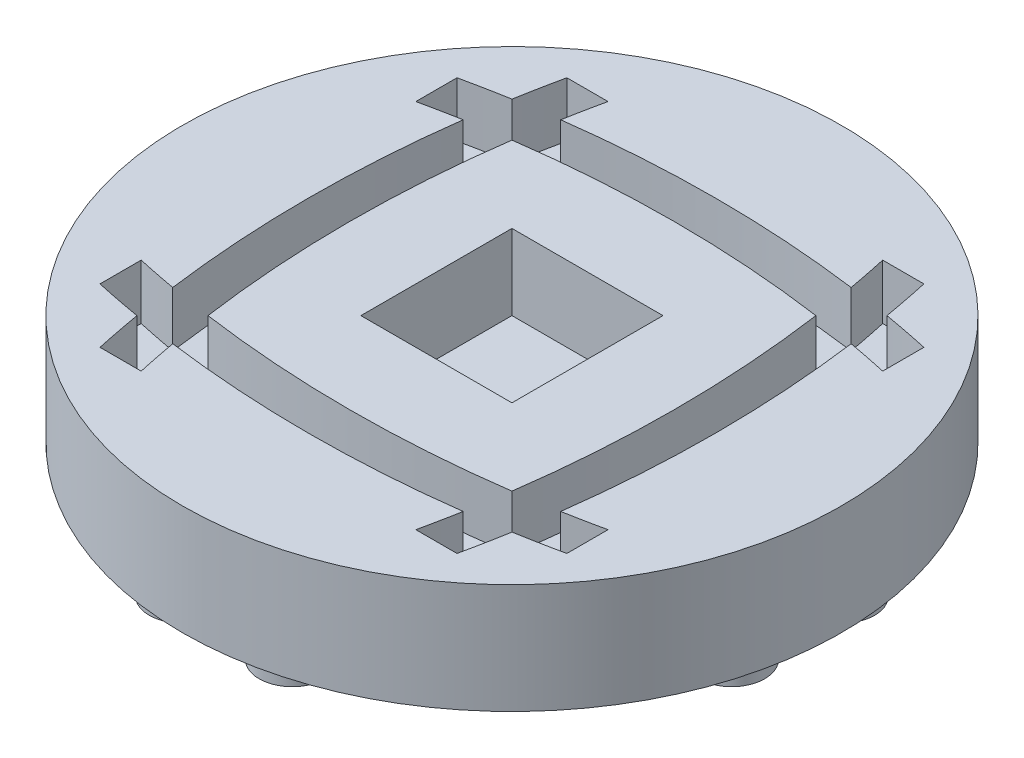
ISO-10303-21;
HEADER;
FILE_DESCRIPTION(('STEP AP214'),'2;1');
FILE_NAME('part.step','',(''),(''),'','','');
FILE_SCHEMA(('AUTOMOTIVE_DESIGN { 1 0 10303 214 1 1 1 1 }'));
ENDSEC;
DATA;
#1=APPLICATION_CONTEXT('core data for automotive mechanical design processes');
#2=APPLICATION_PROTOCOL_DEFINITION('international standard','automotive_design',2000,#1);
#3=PRODUCT_CONTEXT('',#1,'mechanical');
#4=PRODUCT('Part','Part','',(#3));
#5=PRODUCT_RELATED_PRODUCT_CATEGORY('part','',(#4));
#6=PRODUCT_DEFINITION_FORMATION('','',#4);
#7=PRODUCT_DEFINITION_CONTEXT('part definition',#1,'design');
#8=PRODUCT_DEFINITION('design','',#6,#7);
#9=PRODUCT_DEFINITION_SHAPE('','',#8);
#10=(LENGTH_UNIT() NAMED_UNIT(*) SI_UNIT(.MILLI.,.METRE.));
#11=(NAMED_UNIT(*) PLANE_ANGLE_UNIT() SI_UNIT($,.RADIAN.));
#12=(NAMED_UNIT(*) SI_UNIT($,.STERADIAN.) SOLID_ANGLE_UNIT());
#13=UNCERTAINTY_MEASURE_WITH_UNIT(LENGTH_MEASURE(1.E-05),#10,'distance_accuracy_value','');
#14=(GEOMETRIC_REPRESENTATION_CONTEXT(3) GLOBAL_UNCERTAINTY_ASSIGNED_CONTEXT((#13)) GLOBAL_UNIT_ASSIGNED_CONTEXT((#10,
#11,#12)) REPRESENTATION_CONTEXT('',''));
#15=CARTESIAN_POINT('',(0.,0.,0.));
#16=DIRECTION('',(0.,0.,1.));
#17=DIRECTION('',(1.,0.,0.));
#18=AXIS2_PLACEMENT_3D('',#15,#16,#17);
#19=CARTESIAN_POINT('',(0.,8.,0.));
#20=DIRECTION('',(0.,-1.,0.));
#21=DIRECTION('',(0.,0.,-1.));
#22=AXIS2_PLACEMENT_3D('',#19,#20,#21);
#23=CYLINDRICAL_SURFACE('',#22,24.);
#24=CARTESIAN_POINT('',(0.,8.,0.));
#25=DIRECTION('',(0.,1.,0.));
#26=DIRECTION('',(0.,0.,1.));
#27=AXIS2_PLACEMENT_3D('',#24,#25,#26);
#28=CIRCLE('',#27,24.);
#29=CARTESIAN_POINT('',(0.,8.,24.));
#30=VERTEX_POINT('',#29);
#31=EDGE_CURVE('E564',#30,#30,#28,.T.);
#32=ORIENTED_EDGE('',*,*,#31,.F.);
#33=EDGE_LOOP('',(#32));
#34=FACE_BOUND('',#33,.T.);
#35=CARTESIAN_POINT('',(0.,0.,0.));
#36=DIRECTION('',(0.,1.,0.));
#37=DIRECTION('',(0.,0.,1.));
#38=AXIS2_PLACEMENT_3D('',#35,#36,#37);
#39=CIRCLE('',#38,24.);
#40=CARTESIAN_POINT('',(0.,0.,24.));
#41=VERTEX_POINT('',#40);
#42=EDGE_CURVE('E557',#41,#41,#39,.T.);
#43=ORIENTED_EDGE('',*,*,#42,.T.);
#44=EDGE_LOOP('',(#43));
#45=FACE_BOUND('',#44,.T.);
#46=ADVANCED_FACE('F33',(#34,#45),#23,.T.);
#47=CARTESIAN_POINT('',(0.,8.,0.));
#48=DIRECTION('',(0.,1.,0.));
#49=DIRECTION('',(0.,0.,1.));
#50=AXIS2_PLACEMENT_3D('',#47,#48,#49);
#51=PLANE('',#50);
#52=CARTESIAN_POINT('',(0.,8.,65.1728853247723));
#53=DIRECTION('',(0.,1.,0.));
#54=DIRECTION('',(0.,0.,-1.));
#55=AXIS2_PLACEMENT_3D('',#52,#53,#54);
#56=CIRCLE('',#55,80.);
#57=CARTESIAN_POINT('',(-13.6534076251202,8.,-13.6534076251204));
#58=VERTEX_POINT('',#57);
#59=CARTESIAN_POINT('',(-17.,8.,-13.));
#60=VERTEX_POINT('',#59);
#61=EDGE_CURVE('E47',#58,#60,#56,.T.);
#62=ORIENTED_EDGE('',*,*,#61,.F.);
#63=CARTESIAN_POINT('',(65.1728853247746,8.,-3.61937451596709E-12));
#64=DIRECTION('',(0.,1.,0.));
#65=DIRECTION('',(0.,0.,-1.));
#66=AXIS2_PLACEMENT_3D('',#63,#64,#65);
#67=CIRCLE('',#66,80.0000000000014);
#68=CARTESIAN_POINT('',(-12.9999999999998,8.,-17.0000000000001));
#69=VERTEX_POINT('',#68);
#70=EDGE_CURVE('E313',#69,#58,#67,.T.);
#71=ORIENTED_EDGE('',*,*,#70,.F.);
#72=DIRECTION('',(-1.,0.,2.15105711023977E-13));
#73=VECTOR('',#72,1.);
#74=CARTESIAN_POINT('',(-10.0000000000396,8.,-17.0000000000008));
#75=LINE('',#74,#73);
#76=CARTESIAN_POINT('',(-10.0000000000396,8.,-17.0000000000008));
#77=VERTEX_POINT('',#76);
#78=EDGE_CURVE('E471',#77,#69,#75,.T.);
#79=ORIENTED_EDGE('',*,*,#78,.F.);
#80=CARTESIAN_POINT('',(67.4053186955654,8.,-9.76183332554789E-11));
#81=DIRECTION('',(0.,-1.,0.));
#82=DIRECTION('',(0.,0.,-1.));
#83=AXIS2_PLACEMENT_3D('',#80,#81,#82);
#84=CIRCLE('',#83,79.2501316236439);
#85=CARTESIAN_POINT('',(-10.5758870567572,8.,-14.1249747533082));
#86=VERTEX_POINT('',#85);
#87=EDGE_CURVE('E468',#86,#77,#84,.T.);
#88=ORIENTED_EDGE('',*,*,#87,.F.);
#89=CARTESIAN_POINT('',(0.,8.,65.1728853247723));
#90=DIRECTION('',(0.,1.,0.));
#91=DIRECTION('',(0.,0.,-1.));
#92=AXIS2_PLACEMENT_3D('',#89,#90,#91);
#93=CIRCLE('',#92,80.0000000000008);
#94=CARTESIAN_POINT('',(10.5758870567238,8.,-14.1249747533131));
#95=VERTEX_POINT('',#94);
#96=EDGE_CURVE('E465',#95,#86,#93,.T.);
#97=ORIENTED_EDGE('',*,*,#96,.F.);
#98=CARTESIAN_POINT('',(-67.4053186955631,8.,9.37728701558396E-11));
#99=DIRECTION('',(0.,-1.,0.));
#100=DIRECTION('',(0.,0.,-1.));
#101=AXIS2_PLACEMENT_3D('',#98,#99,#100);
#102=CIRCLE('',#101,79.2501316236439);
#103=CARTESIAN_POINT('',(10.0000000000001,8.,-17.));
#104=VERTEX_POINT('',#103);
#105=EDGE_CURVE('E462',#104,#95,#102,.T.);
#106=ORIENTED_EDGE('',*,*,#105,.F.);
#107=DIRECTION('',(-1.,0.,0.));
#108=VECTOR('',#107,1.);
#109=CARTESIAN_POINT('',(13.0000000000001,8.,-17.));
#110=LINE('',#109,#108);
#111=CARTESIAN_POINT('',(13.0000000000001,8.,-17.));
#112=VERTEX_POINT('',#111);
#113=EDGE_CURVE('E459',#112,#104,#110,.T.);
#114=ORIENTED_EDGE('',*,*,#113,.F.);
#115=CARTESIAN_POINT('',(-65.1728853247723,8.,-2.25815189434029E-13));
#116=DIRECTION('',(0.,1.,0.));
#117=DIRECTION('',(0.,0.,-1.));
#118=AXIS2_PLACEMENT_3D('',#115,#116,#117);
#119=CIRCLE('',#118,80.);
#120=CARTESIAN_POINT('',(13.6534076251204,8.,-13.6534076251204));
#121=VERTEX_POINT('',#120);
#122=EDGE_CURVE('E456',#121,#112,#119,.T.);
#123=ORIENTED_EDGE('',*,*,#122,.F.);
#124=CARTESIAN_POINT('',(0.,8.,65.1728853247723));
#125=DIRECTION('',(0.,1.,0.));
#126=DIRECTION('',(0.,0.,-1.));
#127=AXIS2_PLACEMENT_3D('',#124,#125,#126);
#128=CIRCLE('',#127,80.);
#129=CARTESIAN_POINT('',(17.,8.,-13.));
#130=VERTEX_POINT('',#129);
#131=EDGE_CURVE('E453',#130,#121,#128,.T.);
#132=ORIENTED_EDGE('',*,*,#131,.F.);
#133=DIRECTION('',(0.,0.,-1.));
#134=VECTOR('',#133,1.);
#135=CARTESIAN_POINT('',(17.,8.,-10.0000000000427));
#136=LINE('',#135,#134);
#137=CARTESIAN_POINT('',(17.,8.,-10.0000000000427));
#138=VERTEX_POINT('',#137);
#139=EDGE_CURVE('E450',#138,#130,#136,.T.);
#140=ORIENTED_EDGE('',*,*,#139,.F.);
#141=CARTESIAN_POINT('',(9.68253255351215E-11,8.,67.4053186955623));
#142=DIRECTION('',(0.,-1.,0.));
#143=DIRECTION('',(0.,0.,-1.));
#144=AXIS2_PLACEMENT_3D('',#141,#142,#143);
#145=CIRCLE('',#144,79.2501316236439);
#146=CARTESIAN_POINT('',(14.1249747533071,8.,-10.5758870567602));
#147=VERTEX_POINT('',#146);
#148=EDGE_CURVE('E447',#147,#138,#145,.T.);
#149=ORIENTED_EDGE('',*,*,#148,.F.);
#150=CARTESIAN_POINT('',(-65.1728853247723,8.,-2.25815189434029E-13));
#151=DIRECTION('',(0.,1.,0.));
#152=DIRECTION('',(0.,0.,-1.));
#153=AXIS2_PLACEMENT_3D('',#150,#151,#152);
#154=CIRCLE('',#153,80.);
#155=CARTESIAN_POINT('',(14.1249747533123,8.,10.5758870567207));
#156=VERTEX_POINT('',#155);
#157=EDGE_CURVE('E444',#156,#147,#154,.T.);
#158=ORIENTED_EDGE('',*,*,#157,.F.);
#159=CARTESIAN_POINT('',(-9.45576231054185E-11,8.,-67.4053186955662));
#160=DIRECTION('',(0.,-1.,0.));
#161=DIRECTION('',(0.,0.,-1.));
#162=AXIS2_PLACEMENT_3D('',#159,#160,#161);
#163=CIRCLE('',#162,79.2501316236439);
#164=CARTESIAN_POINT('',(17.0000000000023,8.,9.99999999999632));
#165=VERTEX_POINT('',#164);
#166=EDGE_CURVE('E441',#165,#156,#163,.T.);
#167=ORIENTED_EDGE('',*,*,#166,.F.);
#168=DIRECTION('',(0.,0.,-1.));
#169=VECTOR('',#168,1.);
#170=CARTESIAN_POINT('',(17.0000000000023,8.,12.9999999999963));
#171=LINE('',#170,#169);
#172=CARTESIAN_POINT('',(17.0000000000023,8.,12.9999999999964));
#173=VERTEX_POINT('',#172);
#174=EDGE_CURVE('E438',#173,#165,#171,.T.);
#175=ORIENTED_EDGE('',*,*,#174,.F.);
#176=CARTESIAN_POINT('',(4.53365102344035E-13,8.,-65.1728853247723));
#177=DIRECTION('',(0.,1.,0.));
#178=DIRECTION('',(0.,0.,-1.));
#179=AXIS2_PLACEMENT_3D('',#176,#177,#178);
#180=CIRCLE('',#179,79.9999999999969);
#181=CARTESIAN_POINT('',(13.6534076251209,8.,13.6534076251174));
#182=VERTEX_POINT('',#181);
#183=EDGE_CURVE('E435',#182,#173,#180,.T.);
#184=ORIENTED_EDGE('',*,*,#183,.F.);
#185=CARTESIAN_POINT('',(-65.1728853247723,8.,-2.25815189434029E-13));
#186=DIRECTION('',(0.,1.,0.));
#187=DIRECTION('',(0.,0.,-1.));
#188=AXIS2_PLACEMENT_3D('',#185,#186,#187);
#189=CIRCLE('',#188,80.);
#190=CARTESIAN_POINT('',(12.9999999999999,8.,17.));
#191=VERTEX_POINT('',#190);
#192=EDGE_CURVE('E432',#191,#182,#189,.T.);
#193=ORIENTED_EDGE('',*,*,#192,.F.);
#194=DIRECTION('',(1.,0.,1.0327387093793E-12));
#195=VECTOR('',#194,1.);
#196=CARTESIAN_POINT('',(10.0000000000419,8.,16.9999999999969));
#197=LINE('',#196,#195);
#198=CARTESIAN_POINT('',(10.0000000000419,8.,16.999999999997));
#199=VERTEX_POINT('',#198);
#200=EDGE_CURVE('E429',#199,#191,#197,.T.);
#201=ORIENTED_EDGE('',*,*,#200,.F.);
#202=CARTESIAN_POINT('',(-67.4053186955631,8.,9.37728701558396E-11));
#203=DIRECTION('',(0.,-1.,0.));
#204=DIRECTION('',(0.,0.,-1.));
#205=AXIS2_PLACEMENT_3D('',#202,#203,#204);
#206=CIRCLE('',#205,79.2501316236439);
#207=CARTESIAN_POINT('',(10.5758870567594,8.,14.1249747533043));
#208=VERTEX_POINT('',#207);
#209=EDGE_CURVE('E426',#208,#199,#206,.T.);
#210=ORIENTED_EDGE('',*,*,#209,.F.);
#211=CARTESIAN_POINT('',(4.53365102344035E-13,8.,-65.1728853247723));
#212=DIRECTION('',(0.,1.,0.));
#213=DIRECTION('',(0.,0.,-1.));
#214=AXIS2_PLACEMENT_3D('',#211,#212,#213);
#215=CIRCLE('',#214,79.9999999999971);
#216=CARTESIAN_POINT('',(-10.575887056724,8.,14.1249747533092));
#217=VERTEX_POINT('',#216);
#218=EDGE_CURVE('E423',#217,#208,#215,.T.);
#219=ORIENTED_EDGE('',*,*,#218,.F.);
#220=CARTESIAN_POINT('',(67.4053186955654,8.,-9.76183332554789E-11));
#221=DIRECTION('',(0.,-1.,0.));
#222=DIRECTION('',(0.,0.,-1.));
#223=AXIS2_PLACEMENT_3D('',#220,#221,#222);
#224=CIRCLE('',#223,79.2501316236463);
#225=CARTESIAN_POINT('',(-10.0000000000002,8.,16.9999999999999));
#226=VERTEX_POINT('',#225);
#227=EDGE_CURVE('E420',#226,#217,#224,.T.);
#228=ORIENTED_EDGE('',*,*,#227,.F.);
#229=DIRECTION('',(1.,0.,0.));
#230=VECTOR('',#229,1.);
#231=CARTESIAN_POINT('',(-13.0000000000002,8.,16.9999999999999));
#232=LINE('',#231,#230);
#233=CARTESIAN_POINT('',(-12.9999999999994,8.,16.9999999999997));
#234=VERTEX_POINT('',#233);
#235=EDGE_CURVE('E417',#234,#226,#232,.T.);
#236=ORIENTED_EDGE('',*,*,#235,.F.);
#237=CARTESIAN_POINT('',(65.1728853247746,8.,-3.61937451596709E-12));
#238=DIRECTION('',(0.,1.,0.));
#239=DIRECTION('',(0.,0.,-1.));
#240=AXIS2_PLACEMENT_3D('',#237,#238,#239);
#241=CIRCLE('',#240,80.0000000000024);
#242=CARTESIAN_POINT('',(-13.6534076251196,8.,13.6534076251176));
#243=VERTEX_POINT('',#242);
#244=EDGE_CURVE('E414',#243,#234,#241,.T.);
#245=ORIENTED_EDGE('',*,*,#244,.F.);
#246=CARTESIAN_POINT('',(4.53365102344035E-13,8.,-65.1728853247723));
#247=DIRECTION('',(0.,1.,0.));
#248=DIRECTION('',(0.,0.,-1.));
#249=AXIS2_PLACEMENT_3D('',#246,#247,#248);
#250=CIRCLE('',#249,79.9999999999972);
#251=CARTESIAN_POINT('',(-16.9999999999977,8.,12.9999999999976));
#252=VERTEX_POINT('',#251);
#253=EDGE_CURVE('E411',#252,#243,#250,.T.);
#254=ORIENTED_EDGE('',*,*,#253,.F.);
#255=DIRECTION('',(0.,0.,1.));
#256=VECTOR('',#255,1.);
#257=CARTESIAN_POINT('',(-16.9999999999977,8.,10.0000000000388));
#258=LINE('',#257,#256);
#259=CARTESIAN_POINT('',(-16.9999999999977,8.,10.0000000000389));
#260=VERTEX_POINT('',#259);
#261=EDGE_CURVE('E408',#260,#252,#258,.T.);
#262=ORIENTED_EDGE('',*,*,#261,.F.);
#263=CARTESIAN_POINT('',(-9.45576231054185E-11,8.,-67.4053186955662));
#264=DIRECTION('',(0.,-1.,0.));
#265=DIRECTION('',(0.,0.,-1.));
#266=AXIS2_PLACEMENT_3D('',#263,#264,#265);
#267=CIRCLE('',#266,79.2501316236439);
#268=CARTESIAN_POINT('',(-14.1249747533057,8.,10.575887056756));
#269=VERTEX_POINT('',#268);
#270=EDGE_CURVE('E405',#269,#260,#267,.T.);
#271=ORIENTED_EDGE('',*,*,#270,.F.);
#272=CARTESIAN_POINT('',(65.1728853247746,8.,-3.61937451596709E-12));
#273=DIRECTION('',(0.,1.,0.));
#274=DIRECTION('',(0.,0.,-1.));
#275=AXIS2_PLACEMENT_3D('',#272,#273,#274);
#276=CIRCLE('',#275,80.0000000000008);
#277=CARTESIAN_POINT('',(-14.12497475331,8.,-10.5758870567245));
#278=VERTEX_POINT('',#277);
#279=EDGE_CURVE('E402',#278,#269,#276,.T.);
#280=ORIENTED_EDGE('',*,*,#279,.F.);
#281=CARTESIAN_POINT('',(9.68253255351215E-11,8.,67.4053186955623));
#282=DIRECTION('',(0.,-1.,0.));
#283=DIRECTION('',(0.,0.,-1.));
#284=AXIS2_PLACEMENT_3D('',#281,#282,#283);
#285=CIRCLE('',#284,79.2501316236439);
#286=CARTESIAN_POINT('',(-17.,8.,-10.));
#287=VERTEX_POINT('',#286);
#288=EDGE_CURVE('E399',#287,#278,#285,.T.);
#289=ORIENTED_EDGE('',*,*,#288,.F.);
#290=DIRECTION('',(0.,0.,1.));
#291=VECTOR('',#290,1.);
#292=CARTESIAN_POINT('',(-17.,8.,-13.));
#293=LINE('',#292,#291);
#294=EDGE_CURVE('E396',#60,#287,#293,.T.);
#295=ORIENTED_EDGE('',*,*,#294,.F.);
#296=EDGE_LOOP('',(#62,#71,#79,#88,#97,#106,#114,#123,#132,#140,#149,#158,#167,#175,#184,#193,
#201,#210,#219,#228,#236,#245,#254,#262,#271,#280,#289,#295));
#297=FACE_BOUND('',#296,.T.);
#298=ORIENTED_EDGE('',*,*,#31,.T.);
#299=EDGE_LOOP('',(#298));
#300=FACE_BOUND('',#299,.T.);
#301=ADVANCED_FACE('F643',(#297,#300),#51,.T.);
#302=CARTESIAN_POINT('',(0.,0.,0.));
#303=DIRECTION('',(0.,1.,0.));
#304=DIRECTION('',(0.,0.,1.));
#305=AXIS2_PLACEMENT_3D('',#302,#303,#304);
#306=PLANE('',#305);
#307=CARTESIAN_POINT('',(-20.0000000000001,0.,4.));
#308=DIRECTION('',(0.,1.,0.));
#309=DIRECTION('',(0.,0.,1.));
#310=AXIS2_PLACEMENT_3D('',#307,#308,#309);
#311=CIRCLE('',#310,2.41);
#312=CARTESIAN_POINT('',(-20.0000000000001,0.,6.40999999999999));
#313=VERTEX_POINT('',#312);
#314=EDGE_CURVE('E11',#313,#313,#311,.F.);
#315=ORIENTED_EDGE('',*,*,#314,.F.);
#316=EDGE_LOOP('',(#315));
#317=FACE_BOUND('',#316,.T.);
#318=CARTESIAN_POINT('',(-20.0000000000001,0.,-4.));
#319=DIRECTION('',(0.,1.,0.));
#320=DIRECTION('',(0.,0.,1.));
#321=AXIS2_PLACEMENT_3D('',#318,#319,#320);
#322=CIRCLE('',#321,2.41);
#323=CARTESIAN_POINT('',(-20.0000000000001,0.,-1.59000000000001));
#324=VERTEX_POINT('',#323);
#325=EDGE_CURVE('E40',#324,#324,#322,.F.);
#326=ORIENTED_EDGE('',*,*,#325,.F.);
#327=EDGE_LOOP('',(#326));
#328=FACE_BOUND('',#327,.T.);
#329=CARTESIAN_POINT('',(3.99999999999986,0.,20.));
#330=DIRECTION('',(0.,1.,0.));
#331=DIRECTION('',(0.,0.,1.));
#332=AXIS2_PLACEMENT_3D('',#329,#330,#331);
#333=CIRCLE('',#332,2.41);
#334=CARTESIAN_POINT('',(3.99999999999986,0.,22.41));
#335=VERTEX_POINT('',#334);
#336=EDGE_CURVE('E632',#335,#335,#333,.F.);
#337=ORIENTED_EDGE('',*,*,#336,.F.);
#338=EDGE_LOOP('',(#337));
#339=FACE_BOUND('',#338,.T.);
#340=CARTESIAN_POINT('',(-4.00000000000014,0.,20.));
#341=DIRECTION('',(0.,1.,0.));
#342=DIRECTION('',(0.,0.,1.));
#343=AXIS2_PLACEMENT_3D('',#340,#341,#342);
#344=CIRCLE('',#343,2.41);
#345=CARTESIAN_POINT('',(-4.00000000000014,0.,22.41));
#346=VERTEX_POINT('',#345);
#347=EDGE_CURVE('E629',#346,#346,#344,.F.);
#348=ORIENTED_EDGE('',*,*,#347,.F.);
#349=EDGE_LOOP('',(#348));
#350=FACE_BOUND('',#349,.T.);
#351=CARTESIAN_POINT('',(11.9999999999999,0.,12.));
#352=DIRECTION('',(0.,1.,0.));
#353=DIRECTION('',(0.,0.,1.));
#354=AXIS2_PLACEMENT_3D('',#351,#352,#353);
#355=CIRCLE('',#354,2.41);
#356=CARTESIAN_POINT('',(11.9999999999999,0.,14.41));
#357=VERTEX_POINT('',#356);
#358=EDGE_CURVE('E626',#357,#357,#355,.F.);
#359=ORIENTED_EDGE('',*,*,#358,.F.);
#360=EDGE_LOOP('',(#359));
#361=FACE_BOUND('',#360,.T.);
#362=CARTESIAN_POINT('',(3.99999999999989,0.,12.));
#363=DIRECTION('',(0.,1.,0.));
#364=DIRECTION('',(0.,0.,1.));
#365=AXIS2_PLACEMENT_3D('',#362,#363,#364);
#366=CIRCLE('',#365,2.41);
#367=CARTESIAN_POINT('',(3.99999999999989,0.,14.41));
#368=VERTEX_POINT('',#367);
#369=EDGE_CURVE('E623',#368,#368,#366,.F.);
#370=ORIENTED_EDGE('',*,*,#369,.F.);
#371=EDGE_LOOP('',(#370));
#372=FACE_BOUND('',#371,.T.);
#373=CARTESIAN_POINT('',(-4.00000000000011,0.,12.));
#374=DIRECTION('',(0.,1.,0.));
#375=DIRECTION('',(0.,0.,1.));
#376=AXIS2_PLACEMENT_3D('',#373,#374,#375);
#377=CIRCLE('',#376,2.41);
#378=CARTESIAN_POINT('',(-4.00000000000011,0.,14.41));
#379=VERTEX_POINT('',#378);
#380=EDGE_CURVE('E620',#379,#379,#377,.F.);
#381=ORIENTED_EDGE('',*,*,#380,.F.);
#382=EDGE_LOOP('',(#381));
#383=FACE_BOUND('',#382,.T.);
#384=CARTESIAN_POINT('',(-12.0000000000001,0.,12.));
#385=DIRECTION('',(0.,1.,0.));
#386=DIRECTION('',(0.,0.,1.));
#387=AXIS2_PLACEMENT_3D('',#384,#385,#386);
#388=CIRCLE('',#387,2.41);
#389=CARTESIAN_POINT('',(-12.0000000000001,0.,14.41));
#390=VERTEX_POINT('',#389);
#391=EDGE_CURVE('E617',#390,#390,#388,.F.);
#392=ORIENTED_EDGE('',*,*,#391,.F.);
#393=EDGE_LOOP('',(#392));
#394=FACE_BOUND('',#393,.T.);
#395=CARTESIAN_POINT('',(19.9999999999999,0.,4.));
#396=DIRECTION('',(0.,1.,0.));
#397=DIRECTION('',(0.,0.,1.));
#398=AXIS2_PLACEMENT_3D('',#395,#396,#397);
#399=CIRCLE('',#398,2.41);
#400=CARTESIAN_POINT('',(19.9999999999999,0.,6.40999999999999));
#401=VERTEX_POINT('',#400);
#402=EDGE_CURVE('E614',#401,#401,#399,.F.);
#403=ORIENTED_EDGE('',*,*,#402,.F.);
#404=EDGE_LOOP('',(#403));
#405=FACE_BOUND('',#404,.T.);
#406=CARTESIAN_POINT('',(11.9999999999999,0.,4.));
#407=DIRECTION('',(0.,1.,0.));
#408=DIRECTION('',(0.,0.,1.));
#409=AXIS2_PLACEMENT_3D('',#406,#407,#408);
#410=CIRCLE('',#409,2.41);
#411=CARTESIAN_POINT('',(11.9999999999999,0.,6.41));
#412=VERTEX_POINT('',#411);
#413=EDGE_CURVE('E611',#412,#412,#410,.F.);
#414=ORIENTED_EDGE('',*,*,#413,.F.);
#415=EDGE_LOOP('',(#414));
#416=FACE_BOUND('',#415,.T.);
#417=CARTESIAN_POINT('',(3.99999999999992,0.,4.));
#418=DIRECTION('',(0.,1.,0.));
#419=DIRECTION('',(0.,0.,1.));
#420=AXIS2_PLACEMENT_3D('',#417,#418,#419);
#421=CIRCLE('',#420,2.41);
#422=CARTESIAN_POINT('',(3.99999999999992,0.,6.41));
#423=VERTEX_POINT('',#422);
#424=EDGE_CURVE('E608',#423,#423,#421,.F.);
#425=ORIENTED_EDGE('',*,*,#424,.F.);
#426=EDGE_LOOP('',(#425));
#427=FACE_BOUND('',#426,.T.);
#428=CARTESIAN_POINT('',(-4.00000000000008,0.,4.));
#429=DIRECTION('',(0.,1.,0.));
#430=DIRECTION('',(0.,0.,1.));
#431=AXIS2_PLACEMENT_3D('',#428,#429,#430);
#432=CIRCLE('',#431,2.41);
#433=CARTESIAN_POINT('',(-4.00000000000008,0.,6.41));
#434=VERTEX_POINT('',#433);
#435=EDGE_CURVE('E605',#434,#434,#432,.F.);
#436=ORIENTED_EDGE('',*,*,#435,.F.);
#437=EDGE_LOOP('',(#436));
#438=FACE_BOUND('',#437,.T.);
#439=CARTESIAN_POINT('',(-12.0000000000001,0.,4.));
#440=DIRECTION('',(0.,1.,0.));
#441=DIRECTION('',(0.,0.,1.));
#442=AXIS2_PLACEMENT_3D('',#439,#440,#441);
#443=CIRCLE('',#442,2.41);
#444=CARTESIAN_POINT('',(-12.0000000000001,0.,6.41));
#445=VERTEX_POINT('',#444);
#446=EDGE_CURVE('E602',#445,#445,#443,.F.);
#447=ORIENTED_EDGE('',*,*,#446,.F.);
#448=EDGE_LOOP('',(#447));
#449=FACE_BOUND('',#448,.T.);
#450=CARTESIAN_POINT('',(19.9999999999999,0.,-4.));
#451=DIRECTION('',(0.,1.,0.));
#452=DIRECTION('',(0.,0.,1.));
#453=AXIS2_PLACEMENT_3D('',#450,#451,#452);
#454=CIRCLE('',#453,2.41);
#455=CARTESIAN_POINT('',(19.9999999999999,0.,-1.59000000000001));
#456=VERTEX_POINT('',#455);
#457=EDGE_CURVE('E599',#456,#456,#454,.F.);
#458=ORIENTED_EDGE('',*,*,#457,.F.);
#459=EDGE_LOOP('',(#458));
#460=FACE_BOUND('',#459,.T.);
#461=CARTESIAN_POINT('',(11.9999999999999,0.,-4.));
#462=DIRECTION('',(0.,1.,0.));
#463=DIRECTION('',(0.,0.,1.));
#464=AXIS2_PLACEMENT_3D('',#461,#462,#463);
#465=CIRCLE('',#464,2.41);
#466=CARTESIAN_POINT('',(11.9999999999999,0.,-1.59));
#467=VERTEX_POINT('',#466);
#468=EDGE_CURVE('E596',#467,#467,#465,.F.);
#469=ORIENTED_EDGE('',*,*,#468,.F.);
#470=EDGE_LOOP('',(#469));
#471=FACE_BOUND('',#470,.T.);
#472=CARTESIAN_POINT('',(3.99999999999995,0.,-4.));
#473=DIRECTION('',(0.,1.,0.));
#474=DIRECTION('',(0.,0.,1.));
#475=AXIS2_PLACEMENT_3D('',#472,#473,#474);
#476=CIRCLE('',#475,2.41);
#477=CARTESIAN_POINT('',(3.99999999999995,0.,-1.59));
#478=VERTEX_POINT('',#477);
#479=EDGE_CURVE('E593',#478,#478,#476,.F.);
#480=ORIENTED_EDGE('',*,*,#479,.F.);
#481=EDGE_LOOP('',(#480));
#482=FACE_BOUND('',#481,.T.);
#483=CARTESIAN_POINT('',(-4.00000000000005,0.,-4.));
#484=DIRECTION('',(0.,1.,0.));
#485=DIRECTION('',(0.,0.,1.));
#486=AXIS2_PLACEMENT_3D('',#483,#484,#485);
#487=CIRCLE('',#486,2.41);
#488=CARTESIAN_POINT('',(-4.00000000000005,0.,-1.59));
#489=VERTEX_POINT('',#488);
#490=EDGE_CURVE('E590',#489,#489,#487,.F.);
#491=ORIENTED_EDGE('',*,*,#490,.F.);
#492=EDGE_LOOP('',(#491));
#493=FACE_BOUND('',#492,.T.);
#494=CARTESIAN_POINT('',(-12.0000000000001,0.,-4.));
#495=DIRECTION('',(0.,1.,0.));
#496=DIRECTION('',(0.,0.,1.));
#497=AXIS2_PLACEMENT_3D('',#494,#495,#496);
#498=CIRCLE('',#497,2.41);
#499=CARTESIAN_POINT('',(-12.0000000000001,0.,-1.59));
#500=VERTEX_POINT('',#499);
#501=EDGE_CURVE('E587',#500,#500,#498,.F.);
#502=ORIENTED_EDGE('',*,*,#501,.F.);
#503=EDGE_LOOP('',(#502));
#504=FACE_BOUND('',#503,.T.);
#505=CARTESIAN_POINT('',(12.,0.,-12.));
#506=DIRECTION('',(0.,1.,0.));
#507=DIRECTION('',(0.,0.,1.));
#508=AXIS2_PLACEMENT_3D('',#505,#506,#507);
#509=CIRCLE('',#508,2.41);
#510=CARTESIAN_POINT('',(12.,0.,-9.59));
#511=VERTEX_POINT('',#510);
#512=EDGE_CURVE('E584',#511,#511,#509,.F.);
#513=ORIENTED_EDGE('',*,*,#512,.F.);
#514=EDGE_LOOP('',(#513));
#515=FACE_BOUND('',#514,.T.);
#516=CARTESIAN_POINT('',(3.99999999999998,0.,-12.));
#517=DIRECTION('',(0.,1.,0.));
#518=DIRECTION('',(0.,0.,1.));
#519=AXIS2_PLACEMENT_3D('',#516,#517,#518);
#520=CIRCLE('',#519,2.41);
#521=CARTESIAN_POINT('',(3.99999999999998,0.,-9.59));
#522=VERTEX_POINT('',#521);
#523=EDGE_CURVE('E581',#522,#522,#520,.F.);
#524=ORIENTED_EDGE('',*,*,#523,.F.);
#525=EDGE_LOOP('',(#524));
#526=FACE_BOUND('',#525,.T.);
#527=CARTESIAN_POINT('',(-4.00000000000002,0.,-12.));
#528=DIRECTION('',(0.,1.,0.));
#529=DIRECTION('',(0.,0.,1.));
#530=AXIS2_PLACEMENT_3D('',#527,#528,#529);
#531=CIRCLE('',#530,2.41);
#532=CARTESIAN_POINT('',(-4.00000000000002,0.,-9.59));
#533=VERTEX_POINT('',#532);
#534=EDGE_CURVE('E578',#533,#533,#531,.F.);
#535=ORIENTED_EDGE('',*,*,#534,.F.);
#536=EDGE_LOOP('',(#535));
#537=FACE_BOUND('',#536,.T.);
#538=CARTESIAN_POINT('',(-12.,0.,-12.));
#539=DIRECTION('',(0.,1.,0.));
#540=DIRECTION('',(0.,0.,1.));
#541=AXIS2_PLACEMENT_3D('',#538,#539,#540);
#542=CIRCLE('',#541,2.41);
#543=CARTESIAN_POINT('',(-12.,0.,-9.59));
#544=VERTEX_POINT('',#543);
#545=EDGE_CURVE('E575',#544,#544,#542,.F.);
#546=ORIENTED_EDGE('',*,*,#545,.F.);
#547=EDGE_LOOP('',(#546));
#548=FACE_BOUND('',#547,.T.);
#549=CARTESIAN_POINT('',(4.,0.,-20.));
#550=DIRECTION('',(0.,1.,0.));
#551=DIRECTION('',(0.,0.,1.));
#552=AXIS2_PLACEMENT_3D('',#549,#550,#551);
#553=CIRCLE('',#552,2.41);
#554=CARTESIAN_POINT('',(4.,0.,-17.59));
#555=VERTEX_POINT('',#554);
#556=EDGE_CURVE('E572',#555,#555,#553,.F.);
#557=ORIENTED_EDGE('',*,*,#556,.F.);
#558=EDGE_LOOP('',(#557));
#559=FACE_BOUND('',#558,.T.);
#560=CARTESIAN_POINT('',(-4.,0.,-20.));
#561=DIRECTION('',(0.,1.,0.));
#562=DIRECTION('',(0.,0.,1.));
#563=AXIS2_PLACEMENT_3D('',#560,#561,#562);
#564=CIRCLE('',#563,2.41);
#565=CARTESIAN_POINT('',(-4.,0.,-17.59));
#566=VERTEX_POINT('',#565);
#567=EDGE_CURVE('E567',#566,#566,#564,.F.);
#568=ORIENTED_EDGE('',*,*,#567,.F.);
#569=EDGE_LOOP('',(#568));
#570=FACE_BOUND('',#569,.T.);
#571=ORIENTED_EDGE('',*,*,#42,.F.);
#572=EDGE_LOOP('',(#571));
#573=FACE_BOUND('',#572,.T.);
#574=ADVANCED_FACE('F639',(#317,#328,#339,#350,#361,#372,#383,#394,#405,#416,#427,#438,#449,
#460,#471,#482,#493,#504,#515,#526,#537,#548,#559,#570,#573),#306,.F.);
#575=CARTESIAN_POINT('',(0.,4.,65.1728853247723));
#576=DIRECTION('',(0.,1.,0.));
#577=DIRECTION('',(0.,0.,1.));
#578=AXIS2_PLACEMENT_3D('',#575,#576,#577);
#579=CYLINDRICAL_SURFACE('',#578,80.);
#580=ORIENTED_EDGE('',*,*,#61,.T.);
#581=DIRECTION('',(0.,1.,0.));
#582=VECTOR('',#581,1.);
#583=CARTESIAN_POINT('',(-17.,4.,-13.));
#584=LINE('',#583,#582);
#585=CARTESIAN_POINT('',(-17.,4.,-13.));
#586=VERTEX_POINT('',#585);
#587=EDGE_CURVE('E394',#586,#60,#584,.T.);
#588=ORIENTED_EDGE('',*,*,#587,.F.);
#589=CARTESIAN_POINT('',(0.,4.,65.1728853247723));
#590=DIRECTION('',(0.,1.,0.));
#591=DIRECTION('',(0.,0.,-1.));
#592=AXIS2_PLACEMENT_3D('',#589,#590,#591);
#593=CIRCLE('',#592,80.);
#594=CARTESIAN_POINT('',(-13.6534076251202,4.,-13.6534076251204));
#595=VERTEX_POINT('',#594);
#596=EDGE_CURVE('E309',#595,#586,#593,.T.);
#597=ORIENTED_EDGE('',*,*,#596,.F.);
#598=DIRECTION('',(0.,1.,0.));
#599=VECTOR('',#598,1.);
#600=CARTESIAN_POINT('',(-13.6534076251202,4.,-13.6534076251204));
#601=LINE('',#600,#599);
#602=EDGE_CURVE('E476',#595,#58,#601,.T.);
#603=ORIENTED_EDGE('',*,*,#602,.T.);
#604=EDGE_LOOP('',(#580,#588,#597,#603));
#605=FACE_BOUND('',#604,.T.);
#606=ADVANCED_FACE('F642',(#605),#579,.F.);
#607=CARTESIAN_POINT('',(65.1728853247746,4.,-3.61937451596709E-12));
#608=DIRECTION('',(0.,1.,0.));
#609=DIRECTION('',(0.,0.,1.));
#610=AXIS2_PLACEMENT_3D('',#607,#608,#609);
#611=CYLINDRICAL_SURFACE('',#610,80.0000000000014);
#612=ORIENTED_EDGE('',*,*,#70,.T.);
#613=ORIENTED_EDGE('',*,*,#602,.F.);
#614=CARTESIAN_POINT('',(65.1728853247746,4.,-3.61937451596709E-12));
#615=DIRECTION('',(0.,1.,0.));
#616=DIRECTION('',(0.,0.,-1.));
#617=AXIS2_PLACEMENT_3D('',#614,#615,#616);
#618=CIRCLE('',#617,80.0000000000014);
#619=CARTESIAN_POINT('',(-12.9999999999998,4.,-17.0000000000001));
#620=VERTEX_POINT('',#619);
#621=EDGE_CURVE('E391',#620,#595,#618,.T.);
#622=ORIENTED_EDGE('',*,*,#621,.F.);
#623=DIRECTION('',(0.,1.,0.));
#624=VECTOR('',#623,1.);
#625=CARTESIAN_POINT('',(-12.9999999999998,4.,-17.0000000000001));
#626=LINE('',#625,#624);
#627=EDGE_CURVE('E479',#620,#69,#626,.T.);
#628=ORIENTED_EDGE('',*,*,#627,.T.);
#629=EDGE_LOOP('',(#612,#613,#622,#628));
#630=FACE_BOUND('',#629,.T.);
#631=ADVANCED_FACE('F740',(#630),#611,.F.);
#632=CARTESIAN_POINT('',(-10.0000000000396,4.,-17.0000000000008));
#633=DIRECTION('',(-2.15105711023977E-13,0.,-1.));
#634=DIRECTION('',(-1.,0.,2.15105711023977E-13));
#635=AXIS2_PLACEMENT_3D('',#632,#633,#634);
#636=PLANE('',#635);
#637=ORIENTED_EDGE('',*,*,#78,.T.);
#638=ORIENTED_EDGE('',*,*,#627,.F.);
#639=DIRECTION('',(-1.,0.,2.15105711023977E-13));
#640=VECTOR('',#639,1.);
#641=CARTESIAN_POINT('',(-10.0000000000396,4.,-17.0000000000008));
#642=LINE('',#641,#640);
#643=CARTESIAN_POINT('',(-10.0000000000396,4.,-17.0000000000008));
#644=VERTEX_POINT('',#643);
#645=EDGE_CURVE('E388',#644,#620,#642,.T.);
#646=ORIENTED_EDGE('',*,*,#645,.F.);
#647=DIRECTION('',(0.,1.,0.));
#648=VECTOR('',#647,1.);
#649=CARTESIAN_POINT('',(-10.0000000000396,4.,-17.0000000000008));
#650=LINE('',#649,#648);
#651=EDGE_CURVE('E481',#644,#77,#650,.T.);
#652=ORIENTED_EDGE('',*,*,#651,.T.);
#653=EDGE_LOOP('',(#637,#638,#646,#652));
#654=FACE_BOUND('',#653,.T.);
#655=ADVANCED_FACE('F743',(#654),#636,.F.);
#656=CARTESIAN_POINT('',(67.4053186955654,4.,-9.76183332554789E-11));
#657=DIRECTION('',(0.,1.,0.));
#658=DIRECTION('',(0.,0.,1.));
#659=AXIS2_PLACEMENT_3D('',#656,#657,#658);
#660=CYLINDRICAL_SURFACE('',#659,79.2501316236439);
#661=ORIENTED_EDGE('',*,*,#87,.T.);
#662=ORIENTED_EDGE('',*,*,#651,.F.);
#663=CARTESIAN_POINT('',(67.4053186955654,4.,-9.76183332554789E-11));
#664=DIRECTION('',(0.,-1.,0.));
#665=DIRECTION('',(0.,0.,-1.));
#666=AXIS2_PLACEMENT_3D('',#663,#664,#665);
#667=CIRCLE('',#666,79.2501316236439);
#668=CARTESIAN_POINT('',(-10.5758870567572,4.,-14.1249747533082));
#669=VERTEX_POINT('',#668);
#670=EDGE_CURVE('E385',#669,#644,#667,.T.);
#671=ORIENTED_EDGE('',*,*,#670,.F.);
#672=DIRECTION('',(0.,1.,0.));
#673=VECTOR('',#672,1.);
#674=CARTESIAN_POINT('',(-10.5758870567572,4.,-14.1249747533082));
#675=LINE('',#674,#673);
#676=EDGE_CURVE('E483',#669,#86,#675,.T.);
#677=ORIENTED_EDGE('',*,*,#676,.T.);
#678=EDGE_LOOP('',(#661,#662,#671,#677));
#679=FACE_BOUND('',#678,.T.);
#680=ADVANCED_FACE('F747',(#679),#660,.T.);
#681=CARTESIAN_POINT('',(0.,4.,65.1728853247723));
#682=DIRECTION('',(0.,1.,0.));
#683=DIRECTION('',(0.,0.,1.));
#684=AXIS2_PLACEMENT_3D('',#681,#682,#683);
#685=CYLINDRICAL_SURFACE('',#684,80.0000000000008);
#686=ORIENTED_EDGE('',*,*,#96,.T.);
#687=ORIENTED_EDGE('',*,*,#676,.F.);
#688=CARTESIAN_POINT('',(0.,4.,65.1728853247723));
#689=DIRECTION('',(0.,1.,0.));
#690=DIRECTION('',(0.,0.,-1.));
#691=AXIS2_PLACEMENT_3D('',#688,#689,#690);
#692=CIRCLE('',#691,80.0000000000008);
#693=CARTESIAN_POINT('',(10.5758870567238,4.,-14.1249747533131));
#694=VERTEX_POINT('',#693);
#695=EDGE_CURVE('E382',#694,#669,#692,.T.);
#696=ORIENTED_EDGE('',*,*,#695,.F.);
#697=DIRECTION('',(0.,1.,0.));
#698=VECTOR('',#697,1.);
#699=CARTESIAN_POINT('',(10.5758870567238,4.,-14.1249747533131));
#700=LINE('',#699,#698);
#701=EDGE_CURVE('E485',#694,#95,#700,.T.);
#702=ORIENTED_EDGE('',*,*,#701,.T.);
#703=EDGE_LOOP('',(#686,#687,#696,#702));
#704=FACE_BOUND('',#703,.T.);
#705=ADVANCED_FACE('F751',(#704),#685,.F.);
#706=CARTESIAN_POINT('',(-67.4053186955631,4.,9.37728701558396E-11));
#707=DIRECTION('',(0.,1.,0.));
#708=DIRECTION('',(0.,0.,1.));
#709=AXIS2_PLACEMENT_3D('',#706,#707,#708);
#710=CYLINDRICAL_SURFACE('',#709,79.2501316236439);
#711=ORIENTED_EDGE('',*,*,#105,.T.);
#712=ORIENTED_EDGE('',*,*,#701,.F.);
#713=CARTESIAN_POINT('',(-67.4053186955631,4.,9.37728701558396E-11));
#714=DIRECTION('',(0.,-1.,0.));
#715=DIRECTION('',(0.,0.,-1.));
#716=AXIS2_PLACEMENT_3D('',#713,#714,#715);
#717=CIRCLE('',#716,79.2501316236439);
#718=CARTESIAN_POINT('',(10.0000000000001,4.,-17.));
#719=VERTEX_POINT('',#718);
#720=EDGE_CURVE('E379',#719,#694,#717,.T.);
#721=ORIENTED_EDGE('',*,*,#720,.F.);
#722=DIRECTION('',(0.,1.,0.));
#723=VECTOR('',#722,1.);
#724=CARTESIAN_POINT('',(10.0000000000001,4.,-17.));
#725=LINE('',#724,#723);
#726=EDGE_CURVE('E487',#719,#104,#725,.T.);
#727=ORIENTED_EDGE('',*,*,#726,.T.);
#728=EDGE_LOOP('',(#711,#712,#721,#727));
#729=FACE_BOUND('',#728,.T.);
#730=ADVANCED_FACE('F755',(#729),#710,.T.);
#731=CARTESIAN_POINT('',(13.0000000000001,4.,-17.));
#732=DIRECTION('',(0.,0.,-1.));
#733=DIRECTION('',(-1.,0.,0.));
#734=AXIS2_PLACEMENT_3D('',#731,#732,#733);
#735=PLANE('',#734);
#736=ORIENTED_EDGE('',*,*,#113,.T.);
#737=ORIENTED_EDGE('',*,*,#726,.F.);
#738=DIRECTION('',(-1.,0.,0.));
#739=VECTOR('',#738,1.);
#740=CARTESIAN_POINT('',(13.0000000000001,4.,-17.));
#741=LINE('',#740,#739);
#742=CARTESIAN_POINT('',(13.0000000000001,4.,-17.));
#743=VERTEX_POINT('',#742);
#744=EDGE_CURVE('E376',#743,#719,#741,.T.);
#745=ORIENTED_EDGE('',*,*,#744,.F.);
#746=DIRECTION('',(0.,1.,0.));
#747=VECTOR('',#746,1.);
#748=CARTESIAN_POINT('',(13.0000000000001,4.,-17.));
#749=LINE('',#748,#747);
#750=EDGE_CURVE('E489',#743,#112,#749,.T.);
#751=ORIENTED_EDGE('',*,*,#750,.T.);
#752=EDGE_LOOP('',(#736,#737,#745,#751));
#753=FACE_BOUND('',#752,.T.);
#754=ADVANCED_FACE('F759',(#753),#735,.F.);
#755=CARTESIAN_POINT('',(-65.1728853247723,4.,-2.25815189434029E-13));
#756=DIRECTION('',(0.,1.,0.));
#757=DIRECTION('',(0.,0.,1.));
#758=AXIS2_PLACEMENT_3D('',#755,#756,#757);
#759=CYLINDRICAL_SURFACE('',#758,80.);
#760=ORIENTED_EDGE('',*,*,#122,.T.);
#761=ORIENTED_EDGE('',*,*,#750,.F.);
#762=CARTESIAN_POINT('',(-65.1728853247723,4.,-2.25815189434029E-13));
#763=DIRECTION('',(0.,1.,0.));
#764=DIRECTION('',(0.,0.,-1.));
#765=AXIS2_PLACEMENT_3D('',#762,#763,#764);
#766=CIRCLE('',#765,80.);
#767=CARTESIAN_POINT('',(13.6534076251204,4.,-13.6534076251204));
#768=VERTEX_POINT('',#767);
#769=EDGE_CURVE('E373',#768,#743,#766,.T.);
#770=ORIENTED_EDGE('',*,*,#769,.F.);
#771=DIRECTION('',(0.,1.,0.));
#772=VECTOR('',#771,1.);
#773=CARTESIAN_POINT('',(13.6534076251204,4.,-13.6534076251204));
#774=LINE('',#773,#772);
#775=EDGE_CURVE('E491',#768,#121,#774,.T.);
#776=ORIENTED_EDGE('',*,*,#775,.T.);
#777=EDGE_LOOP('',(#760,#761,#770,#776));
#778=FACE_BOUND('',#777,.T.);
#779=ADVANCED_FACE('F763',(#778),#759,.F.);
#780=CARTESIAN_POINT('',(0.,4.,65.1728853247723));
#781=DIRECTION('',(0.,1.,0.));
#782=DIRECTION('',(0.,0.,1.));
#783=AXIS2_PLACEMENT_3D('',#780,#781,#782);
#784=CYLINDRICAL_SURFACE('',#783,80.);
#785=ORIENTED_EDGE('',*,*,#131,.T.);
#786=ORIENTED_EDGE('',*,*,#775,.F.);
#787=CARTESIAN_POINT('',(0.,4.,65.1728853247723));
#788=DIRECTION('',(0.,1.,0.));
#789=DIRECTION('',(0.,0.,-1.));
#790=AXIS2_PLACEMENT_3D('',#787,#788,#789);
#791=CIRCLE('',#790,80.);
#792=CARTESIAN_POINT('',(17.,4.,-13.));
#793=VERTEX_POINT('',#792);
#794=EDGE_CURVE('E370',#793,#768,#791,.T.);
#795=ORIENTED_EDGE('',*,*,#794,.F.);
#796=DIRECTION('',(0.,1.,0.));
#797=VECTOR('',#796,1.);
#798=CARTESIAN_POINT('',(17.,4.,-13.));
#799=LINE('',#798,#797);
#800=EDGE_CURVE('E493',#793,#130,#799,.T.);
#801=ORIENTED_EDGE('',*,*,#800,.T.);
#802=EDGE_LOOP('',(#785,#786,#795,#801));
#803=FACE_BOUND('',#802,.T.);
#804=ADVANCED_FACE('F767',(#803),#784,.F.);
#805=CARTESIAN_POINT('',(17.,4.,-10.0000000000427));
#806=DIRECTION('',(1.,0.,0.));
#807=DIRECTION('',(0.,0.,-1.));
#808=AXIS2_PLACEMENT_3D('',#805,#806,#807);
#809=PLANE('',#808);
#810=ORIENTED_EDGE('',*,*,#139,.T.);
#811=ORIENTED_EDGE('',*,*,#800,.F.);
#812=DIRECTION('',(0.,0.,-1.));
#813=VECTOR('',#812,1.);
#814=CARTESIAN_POINT('',(17.,4.,-10.0000000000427));
#815=LINE('',#814,#813);
#816=CARTESIAN_POINT('',(17.,4.,-10.0000000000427));
#817=VERTEX_POINT('',#816);
#818=EDGE_CURVE('E367',#817,#793,#815,.T.);
#819=ORIENTED_EDGE('',*,*,#818,.F.);
#820=DIRECTION('',(0.,1.,0.));
#821=VECTOR('',#820,1.);
#822=CARTESIAN_POINT('',(17.,4.,-10.0000000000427));
#823=LINE('',#822,#821);
#824=EDGE_CURVE('E495',#817,#138,#823,.T.);
#825=ORIENTED_EDGE('',*,*,#824,.T.);
#826=EDGE_LOOP('',(#810,#811,#819,#825));
#827=FACE_BOUND('',#826,.T.);
#828=ADVANCED_FACE('F771',(#827),#809,.F.);
#829=CARTESIAN_POINT('',(9.68253255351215E-11,4.,67.4053186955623));
#830=DIRECTION('',(0.,1.,0.));
#831=DIRECTION('',(0.,0.,1.));
#832=AXIS2_PLACEMENT_3D('',#829,#830,#831);
#833=CYLINDRICAL_SURFACE('',#832,79.2501316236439);
#834=ORIENTED_EDGE('',*,*,#148,.T.);
#835=ORIENTED_EDGE('',*,*,#824,.F.);
#836=CARTESIAN_POINT('',(9.68253255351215E-11,4.,67.4053186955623));
#837=DIRECTION('',(0.,-1.,0.));
#838=DIRECTION('',(0.,0.,-1.));
#839=AXIS2_PLACEMENT_3D('',#836,#837,#838);
#840=CIRCLE('',#839,79.2501316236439);
#841=CARTESIAN_POINT('',(14.1249747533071,4.,-10.5758870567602));
#842=VERTEX_POINT('',#841);
#843=EDGE_CURVE('E364',#842,#817,#840,.T.);
#844=ORIENTED_EDGE('',*,*,#843,.F.);
#845=DIRECTION('',(0.,1.,0.));
#846=VECTOR('',#845,1.);
#847=CARTESIAN_POINT('',(14.1249747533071,4.,-10.5758870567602));
#848=LINE('',#847,#846);
#849=EDGE_CURVE('E497',#842,#147,#848,.T.);
#850=ORIENTED_EDGE('',*,*,#849,.T.);
#851=EDGE_LOOP('',(#834,#835,#844,#850));
#852=FACE_BOUND('',#851,.T.);
#853=ADVANCED_FACE('F775',(#852),#833,.T.);
#854=CARTESIAN_POINT('',(-65.1728853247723,4.,-2.25815189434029E-13));
#855=DIRECTION('',(0.,1.,0.));
#856=DIRECTION('',(0.,0.,1.));
#857=AXIS2_PLACEMENT_3D('',#854,#855,#856);
#858=CYLINDRICAL_SURFACE('',#857,80.);
#859=ORIENTED_EDGE('',*,*,#157,.T.);
#860=ORIENTED_EDGE('',*,*,#849,.F.);
#861=CARTESIAN_POINT('',(-65.1728853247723,4.,-2.25815189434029E-13));
#862=DIRECTION('',(0.,1.,0.));
#863=DIRECTION('',(0.,0.,-1.));
#864=AXIS2_PLACEMENT_3D('',#861,#862,#863);
#865=CIRCLE('',#864,80.);
#866=CARTESIAN_POINT('',(14.1249747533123,4.,10.5758870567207));
#867=VERTEX_POINT('',#866);
#868=EDGE_CURVE('E361',#867,#842,#865,.T.);
#869=ORIENTED_EDGE('',*,*,#868,.F.);
#870=DIRECTION('',(0.,1.,0.));
#871=VECTOR('',#870,1.);
#872=CARTESIAN_POINT('',(14.1249747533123,4.,10.5758870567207));
#873=LINE('',#872,#871);
#874=EDGE_CURVE('E499',#867,#156,#873,.T.);
#875=ORIENTED_EDGE('',*,*,#874,.T.);
#876=EDGE_LOOP('',(#859,#860,#869,#875));
#877=FACE_BOUND('',#876,.T.);
#878=ADVANCED_FACE('F779',(#877),#858,.F.);
#879=CARTESIAN_POINT('',(-9.45576231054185E-11,4.,-67.4053186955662));
#880=DIRECTION('',(0.,1.,0.));
#881=DIRECTION('',(0.,0.,1.));
#882=AXIS2_PLACEMENT_3D('',#879,#880,#881);
#883=CYLINDRICAL_SURFACE('',#882,79.2501316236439);
#884=ORIENTED_EDGE('',*,*,#166,.T.);
#885=ORIENTED_EDGE('',*,*,#874,.F.);
#886=CARTESIAN_POINT('',(-9.45576231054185E-11,4.,-67.4053186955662));
#887=DIRECTION('',(0.,-1.,0.));
#888=DIRECTION('',(0.,0.,-1.));
#889=AXIS2_PLACEMENT_3D('',#886,#887,#888);
#890=CIRCLE('',#889,79.2501316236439);
#891=CARTESIAN_POINT('',(17.0000000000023,4.,9.99999999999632));
#892=VERTEX_POINT('',#891);
#893=EDGE_CURVE('E358',#892,#867,#890,.T.);
#894=ORIENTED_EDGE('',*,*,#893,.F.);
#895=DIRECTION('',(0.,1.,0.));
#896=VECTOR('',#895,1.);
#897=CARTESIAN_POINT('',(17.0000000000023,4.,9.99999999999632));
#898=LINE('',#897,#896);
#899=EDGE_CURVE('E501',#892,#165,#898,.T.);
#900=ORIENTED_EDGE('',*,*,#899,.T.);
#901=EDGE_LOOP('',(#884,#885,#894,#900));
#902=FACE_BOUND('',#901,.T.);
#903=ADVANCED_FACE('F783',(#902),#883,.T.);
#904=CARTESIAN_POINT('',(17.0000000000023,4.,12.9999999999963));
#905=DIRECTION('',(1.,0.,0.));
#906=DIRECTION('',(0.,0.,-1.));
#907=AXIS2_PLACEMENT_3D('',#904,#905,#906);
#908=PLANE('',#907);
#909=ORIENTED_EDGE('',*,*,#174,.T.);
#910=ORIENTED_EDGE('',*,*,#899,.F.);
#911=DIRECTION('',(0.,0.,-1.));
#912=VECTOR('',#911,1.);
#913=CARTESIAN_POINT('',(17.0000000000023,4.,12.9999999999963));
#914=LINE('',#913,#912);
#915=CARTESIAN_POINT('',(17.0000000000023,4.,12.9999999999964));
#916=VERTEX_POINT('',#915);
#917=EDGE_CURVE('E355',#916,#892,#914,.T.);
#918=ORIENTED_EDGE('',*,*,#917,.F.);
#919=DIRECTION('',(0.,1.,0.));
#920=VECTOR('',#919,1.);
#921=CARTESIAN_POINT('',(17.0000000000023,4.,12.9999999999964));
#922=LINE('',#921,#920);
#923=EDGE_CURVE('E503',#916,#173,#922,.T.);
#924=ORIENTED_EDGE('',*,*,#923,.T.);
#925=EDGE_LOOP('',(#909,#910,#918,#924));
#926=FACE_BOUND('',#925,.T.);
#927=ADVANCED_FACE('F787',(#926),#908,.F.);
#928=CARTESIAN_POINT('',(4.53365102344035E-13,4.,-65.1728853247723));
#929=DIRECTION('',(0.,1.,0.));
#930=DIRECTION('',(0.,0.,1.));
#931=AXIS2_PLACEMENT_3D('',#928,#929,#930);
#932=CYLINDRICAL_SURFACE('',#931,79.9999999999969);
#933=ORIENTED_EDGE('',*,*,#183,.T.);
#934=ORIENTED_EDGE('',*,*,#923,.F.);
#935=CARTESIAN_POINT('',(4.53365102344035E-13,4.,-65.1728853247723));
#936=DIRECTION('',(0.,1.,0.));
#937=DIRECTION('',(0.,0.,-1.));
#938=AXIS2_PLACEMENT_3D('',#935,#936,#937);
#939=CIRCLE('',#938,79.9999999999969);
#940=CARTESIAN_POINT('',(13.6534076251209,4.,13.6534076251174));
#941=VERTEX_POINT('',#940);
#942=EDGE_CURVE('E352',#941,#916,#939,.T.);
#943=ORIENTED_EDGE('',*,*,#942,.F.);
#944=DIRECTION('',(0.,1.,0.));
#945=VECTOR('',#944,1.);
#946=CARTESIAN_POINT('',(13.6534076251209,4.,13.6534076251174));
#947=LINE('',#946,#945);
#948=EDGE_CURVE('E505',#941,#182,#947,.T.);
#949=ORIENTED_EDGE('',*,*,#948,.T.);
#950=EDGE_LOOP('',(#933,#934,#943,#949));
#951=FACE_BOUND('',#950,.T.);
#952=ADVANCED_FACE('F791',(#951),#932,.F.);
#953=CARTESIAN_POINT('',(-65.1728853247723,4.,-2.25815189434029E-13));
#954=DIRECTION('',(0.,1.,0.));
#955=DIRECTION('',(0.,0.,1.));
#956=AXIS2_PLACEMENT_3D('',#953,#954,#955);
#957=CYLINDRICAL_SURFACE('',#956,80.);
#958=ORIENTED_EDGE('',*,*,#192,.T.);
#959=ORIENTED_EDGE('',*,*,#948,.F.);
#960=CARTESIAN_POINT('',(-65.1728853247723,4.,-2.25815189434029E-13));
#961=DIRECTION('',(0.,1.,0.));
#962=DIRECTION('',(0.,0.,-1.));
#963=AXIS2_PLACEMENT_3D('',#960,#961,#962);
#964=CIRCLE('',#963,80.);
#965=CARTESIAN_POINT('',(12.9999999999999,4.,17.));
#966=VERTEX_POINT('',#965);
#967=EDGE_CURVE('E349',#966,#941,#964,.T.);
#968=ORIENTED_EDGE('',*,*,#967,.F.);
#969=DIRECTION('',(0.,1.,0.));
#970=VECTOR('',#969,1.);
#971=CARTESIAN_POINT('',(12.9999999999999,4.,17.));
#972=LINE('',#971,#970);
#973=EDGE_CURVE('E507',#966,#191,#972,.T.);
#974=ORIENTED_EDGE('',*,*,#973,.T.);
#975=EDGE_LOOP('',(#958,#959,#968,#974));
#976=FACE_BOUND('',#975,.T.);
#977=ADVANCED_FACE('F795',(#976),#957,.F.);
#978=CARTESIAN_POINT('',(10.0000000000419,4.,16.9999999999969));
#979=DIRECTION('',(-1.0327387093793E-12,0.,1.));
#980=DIRECTION('',(1.,0.,1.0327387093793E-12));
#981=AXIS2_PLACEMENT_3D('',#978,#979,#980);
#982=PLANE('',#981);
#983=ORIENTED_EDGE('',*,*,#200,.T.);
#984=ORIENTED_EDGE('',*,*,#973,.F.);
#985=DIRECTION('',(1.,0.,1.0327387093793E-12));
#986=VECTOR('',#985,1.);
#987=CARTESIAN_POINT('',(10.0000000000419,4.,16.9999999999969));
#988=LINE('',#987,#986);
#989=CARTESIAN_POINT('',(10.0000000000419,4.,16.999999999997));
#990=VERTEX_POINT('',#989);
#991=EDGE_CURVE('E346',#990,#966,#988,.T.);
#992=ORIENTED_EDGE('',*,*,#991,.F.);
#993=DIRECTION('',(0.,1.,0.));
#994=VECTOR('',#993,1.);
#995=CARTESIAN_POINT('',(10.0000000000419,4.,16.999999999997));
#996=LINE('',#995,#994);
#997=EDGE_CURVE('E509',#990,#199,#996,.T.);
#998=ORIENTED_EDGE('',*,*,#997,.T.);
#999=EDGE_LOOP('',(#983,#984,#992,#998));
#1000=FACE_BOUND('',#999,.T.);
#1001=ADVANCED_FACE('F799',(#1000),#982,.F.);
#1002=CARTESIAN_POINT('',(-67.4053186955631,4.,9.37728701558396E-11));
#1003=DIRECTION('',(0.,1.,0.));
#1004=DIRECTION('',(0.,0.,1.));
#1005=AXIS2_PLACEMENT_3D('',#1002,#1003,#1004);
#1006=CYLINDRICAL_SURFACE('',#1005,79.2501316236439);
#1007=ORIENTED_EDGE('',*,*,#209,.T.);
#1008=ORIENTED_EDGE('',*,*,#997,.F.);
#1009=CARTESIAN_POINT('',(-67.4053186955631,4.,9.37728701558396E-11));
#1010=DIRECTION('',(0.,-1.,0.));
#1011=DIRECTION('',(0.,0.,-1.));
#1012=AXIS2_PLACEMENT_3D('',#1009,#1010,#1011);
#1013=CIRCLE('',#1012,79.2501316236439);
#1014=CARTESIAN_POINT('',(10.5758870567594,4.,14.1249747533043));
#1015=VERTEX_POINT('',#1014);
#1016=EDGE_CURVE('E343',#1015,#990,#1013,.T.);
#1017=ORIENTED_EDGE('',*,*,#1016,.F.);
#1018=DIRECTION('',(0.,1.,0.));
#1019=VECTOR('',#1018,1.);
#1020=CARTESIAN_POINT('',(10.5758870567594,4.,14.1249747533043));
#1021=LINE('',#1020,#1019);
#1022=EDGE_CURVE('E511',#1015,#208,#1021,.T.);
#1023=ORIENTED_EDGE('',*,*,#1022,.T.);
#1024=EDGE_LOOP('',(#1007,#1008,#1017,#1023));
#1025=FACE_BOUND('',#1024,.T.);
#1026=ADVANCED_FACE('F803',(#1025),#1006,.T.);
#1027=CARTESIAN_POINT('',(4.53365102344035E-13,4.,-65.1728853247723));
#1028=DIRECTION('',(0.,1.,0.));
#1029=DIRECTION('',(0.,0.,1.));
#1030=AXIS2_PLACEMENT_3D('',#1027,#1028,#1029);
#1031=CYLINDRICAL_SURFACE('',#1030,79.9999999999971);
#1032=ORIENTED_EDGE('',*,*,#218,.T.);
#1033=ORIENTED_EDGE('',*,*,#1022,.F.);
#1034=CARTESIAN_POINT('',(4.53365102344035E-13,4.,-65.1728853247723));
#1035=DIRECTION('',(0.,1.,0.));
#1036=DIRECTION('',(0.,0.,-1.));
#1037=AXIS2_PLACEMENT_3D('',#1034,#1035,#1036);
#1038=CIRCLE('',#1037,79.9999999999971);
#1039=CARTESIAN_POINT('',(-10.575887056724,4.,14.1249747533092));
#1040=VERTEX_POINT('',#1039);
#1041=EDGE_CURVE('E340',#1040,#1015,#1038,.T.);
#1042=ORIENTED_EDGE('',*,*,#1041,.F.);
#1043=DIRECTION('',(0.,1.,0.));
#1044=VECTOR('',#1043,1.);
#1045=CARTESIAN_POINT('',(-10.575887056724,4.,14.1249747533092));
#1046=LINE('',#1045,#1044);
#1047=EDGE_CURVE('E513',#1040,#217,#1046,.T.);
#1048=ORIENTED_EDGE('',*,*,#1047,.T.);
#1049=EDGE_LOOP('',(#1032,#1033,#1042,#1048));
#1050=FACE_BOUND('',#1049,.T.);
#1051=ADVANCED_FACE('F807',(#1050),#1031,.F.);
#1052=CARTESIAN_POINT('',(67.4053186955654,4.,-9.76183332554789E-11));
#1053=DIRECTION('',(0.,1.,0.));
#1054=DIRECTION('',(0.,0.,1.));
#1055=AXIS2_PLACEMENT_3D('',#1052,#1053,#1054);
#1056=CYLINDRICAL_SURFACE('',#1055,79.2501316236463);
#1057=ORIENTED_EDGE('',*,*,#227,.T.);
#1058=ORIENTED_EDGE('',*,*,#1047,.F.);
#1059=CARTESIAN_POINT('',(67.4053186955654,4.,-9.76183332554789E-11));
#1060=DIRECTION('',(0.,-1.,0.));
#1061=DIRECTION('',(0.,0.,-1.));
#1062=AXIS2_PLACEMENT_3D('',#1059,#1060,#1061);
#1063=CIRCLE('',#1062,79.2501316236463);
#1064=CARTESIAN_POINT('',(-10.0000000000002,4.,16.9999999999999));
#1065=VERTEX_POINT('',#1064);
#1066=EDGE_CURVE('E337',#1065,#1040,#1063,.T.);
#1067=ORIENTED_EDGE('',*,*,#1066,.F.);
#1068=DIRECTION('',(0.,1.,0.));
#1069=VECTOR('',#1068,1.);
#1070=CARTESIAN_POINT('',(-10.0000000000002,4.,16.9999999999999));
#1071=LINE('',#1070,#1069);
#1072=EDGE_CURVE('E515',#1065,#226,#1071,.T.);
#1073=ORIENTED_EDGE('',*,*,#1072,.T.);
#1074=EDGE_LOOP('',(#1057,#1058,#1067,#1073));
#1075=FACE_BOUND('',#1074,.T.);
#1076=ADVANCED_FACE('F811',(#1075),#1056,.T.);
#1077=CARTESIAN_POINT('',(-13.0000000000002,4.,16.9999999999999));
#1078=DIRECTION('',(0.,0.,1.));
#1079=DIRECTION('',(1.,0.,0.));
#1080=AXIS2_PLACEMENT_3D('',#1077,#1078,#1079);
#1081=PLANE('',#1080);
#1082=ORIENTED_EDGE('',*,*,#235,.T.);
#1083=ORIENTED_EDGE('',*,*,#1072,.F.);
#1084=DIRECTION('',(1.,0.,0.));
#1085=VECTOR('',#1084,1.);
#1086=CARTESIAN_POINT('',(-13.0000000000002,4.,16.9999999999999));
#1087=LINE('',#1086,#1085);
#1088=CARTESIAN_POINT('',(-12.9999999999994,4.,16.9999999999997));
#1089=VERTEX_POINT('',#1088);
#1090=EDGE_CURVE('E334',#1089,#1065,#1087,.T.);
#1091=ORIENTED_EDGE('',*,*,#1090,.F.);
#1092=DIRECTION('',(0.,1.,0.));
#1093=VECTOR('',#1092,1.);
#1094=CARTESIAN_POINT('',(-12.9999999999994,4.,16.9999999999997));
#1095=LINE('',#1094,#1093);
#1096=EDGE_CURVE('E517',#1089,#234,#1095,.T.);
#1097=ORIENTED_EDGE('',*,*,#1096,.T.);
#1098=EDGE_LOOP('',(#1082,#1083,#1091,#1097));
#1099=FACE_BOUND('',#1098,.T.);
#1100=ADVANCED_FACE('F815',(#1099),#1081,.F.);
#1101=CARTESIAN_POINT('',(65.1728853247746,4.,-3.61937451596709E-12));
#1102=DIRECTION('',(0.,1.,0.));
#1103=DIRECTION('',(0.,0.,1.));
#1104=AXIS2_PLACEMENT_3D('',#1101,#1102,#1103);
#1105=CYLINDRICAL_SURFACE('',#1104,80.0000000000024);
#1106=ORIENTED_EDGE('',*,*,#244,.T.);
#1107=ORIENTED_EDGE('',*,*,#1096,.F.);
#1108=CARTESIAN_POINT('',(65.1728853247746,4.,-3.61937451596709E-12));
#1109=DIRECTION('',(0.,1.,0.));
#1110=DIRECTION('',(0.,0.,-1.));
#1111=AXIS2_PLACEMENT_3D('',#1108,#1109,#1110);
#1112=CIRCLE('',#1111,80.0000000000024);
#1113=CARTESIAN_POINT('',(-13.6534076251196,4.,13.6534076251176));
#1114=VERTEX_POINT('',#1113);
#1115=EDGE_CURVE('E331',#1114,#1089,#1112,.T.);
#1116=ORIENTED_EDGE('',*,*,#1115,.F.);
#1117=DIRECTION('',(0.,1.,0.));
#1118=VECTOR('',#1117,1.);
#1119=CARTESIAN_POINT('',(-13.6534076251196,4.,13.6534076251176));
#1120=LINE('',#1119,#1118);
#1121=EDGE_CURVE('E519',#1114,#243,#1120,.T.);
#1122=ORIENTED_EDGE('',*,*,#1121,.T.);
#1123=EDGE_LOOP('',(#1106,#1107,#1116,#1122));
#1124=FACE_BOUND('',#1123,.T.);
#1125=ADVANCED_FACE('F819',(#1124),#1105,.F.);
#1126=CARTESIAN_POINT('',(4.53365102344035E-13,4.,-65.1728853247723));
#1127=DIRECTION('',(0.,1.,0.));
#1128=DIRECTION('',(0.,0.,1.));
#1129=AXIS2_PLACEMENT_3D('',#1126,#1127,#1128);
#1130=CYLINDRICAL_SURFACE('',#1129,79.9999999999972);
#1131=ORIENTED_EDGE('',*,*,#253,.T.);
#1132=ORIENTED_EDGE('',*,*,#1121,.F.);
#1133=CARTESIAN_POINT('',(4.53365102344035E-13,4.,-65.1728853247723));
#1134=DIRECTION('',(0.,1.,0.));
#1135=DIRECTION('',(0.,0.,-1.));
#1136=AXIS2_PLACEMENT_3D('',#1133,#1134,#1135);
#1137=CIRCLE('',#1136,79.9999999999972);
#1138=CARTESIAN_POINT('',(-16.9999999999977,4.,12.9999999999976));
#1139=VERTEX_POINT('',#1138);
#1140=EDGE_CURVE('E328',#1139,#1114,#1137,.T.);
#1141=ORIENTED_EDGE('',*,*,#1140,.F.);
#1142=DIRECTION('',(0.,1.,0.));
#1143=VECTOR('',#1142,1.);
#1144=CARTESIAN_POINT('',(-16.9999999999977,4.,12.9999999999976));
#1145=LINE('',#1144,#1143);
#1146=EDGE_CURVE('E521',#1139,#252,#1145,.T.);
#1147=ORIENTED_EDGE('',*,*,#1146,.T.);
#1148=EDGE_LOOP('',(#1131,#1132,#1141,#1147));
#1149=FACE_BOUND('',#1148,.T.);
#1150=ADVANCED_FACE('F823',(#1149),#1130,.F.);
#1151=CARTESIAN_POINT('',(-16.9999999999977,4.,10.0000000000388));
#1152=DIRECTION('',(-1.,0.,0.));
#1153=DIRECTION('',(0.,0.,1.));
#1154=AXIS2_PLACEMENT_3D('',#1151,#1152,#1153);
#1155=PLANE('',#1154);
#1156=ORIENTED_EDGE('',*,*,#261,.T.);
#1157=ORIENTED_EDGE('',*,*,#1146,.F.);
#1158=DIRECTION('',(0.,0.,1.));
#1159=VECTOR('',#1158,1.);
#1160=CARTESIAN_POINT('',(-16.9999999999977,4.,10.0000000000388));
#1161=LINE('',#1160,#1159);
#1162=CARTESIAN_POINT('',(-16.9999999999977,4.,10.0000000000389));
#1163=VERTEX_POINT('',#1162);
#1164=EDGE_CURVE('E325',#1163,#1139,#1161,.T.);
#1165=ORIENTED_EDGE('',*,*,#1164,.F.);
#1166=DIRECTION('',(0.,1.,0.));
#1167=VECTOR('',#1166,1.);
#1168=CARTESIAN_POINT('',(-16.9999999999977,4.,10.0000000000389));
#1169=LINE('',#1168,#1167);
#1170=EDGE_CURVE('E523',#1163,#260,#1169,.T.);
#1171=ORIENTED_EDGE('',*,*,#1170,.T.);
#1172=EDGE_LOOP('',(#1156,#1157,#1165,#1171));
#1173=FACE_BOUND('',#1172,.T.);
#1174=ADVANCED_FACE('F827',(#1173),#1155,.F.);
#1175=CARTESIAN_POINT('',(-9.45576231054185E-11,4.,-67.4053186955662));
#1176=DIRECTION('',(0.,1.,0.));
#1177=DIRECTION('',(0.,0.,1.));
#1178=AXIS2_PLACEMENT_3D('',#1175,#1176,#1177);
#1179=CYLINDRICAL_SURFACE('',#1178,79.2501316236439);
#1180=ORIENTED_EDGE('',*,*,#270,.T.);
#1181=ORIENTED_EDGE('',*,*,#1170,.F.);
#1182=CARTESIAN_POINT('',(-9.45576231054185E-11,4.,-67.4053186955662));
#1183=DIRECTION('',(0.,-1.,0.));
#1184=DIRECTION('',(0.,0.,-1.));
#1185=AXIS2_PLACEMENT_3D('',#1182,#1183,#1184);
#1186=CIRCLE('',#1185,79.2501316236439);
#1187=CARTESIAN_POINT('',(-14.1249747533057,4.,10.575887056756));
#1188=VERTEX_POINT('',#1187);
#1189=EDGE_CURVE('E322',#1188,#1163,#1186,.T.);
#1190=ORIENTED_EDGE('',*,*,#1189,.F.);
#1191=DIRECTION('',(0.,1.,0.));
#1192=VECTOR('',#1191,1.);
#1193=CARTESIAN_POINT('',(-14.1249747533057,4.,10.575887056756));
#1194=LINE('',#1193,#1192);
#1195=EDGE_CURVE('E525',#1188,#269,#1194,.T.);
#1196=ORIENTED_EDGE('',*,*,#1195,.T.);
#1197=EDGE_LOOP('',(#1180,#1181,#1190,#1196));
#1198=FACE_BOUND('',#1197,.T.);
#1199=ADVANCED_FACE('F831',(#1198),#1179,.T.);
#1200=CARTESIAN_POINT('',(65.1728853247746,4.,-3.61937451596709E-12));
#1201=DIRECTION('',(0.,1.,0.));
#1202=DIRECTION('',(0.,0.,1.));
#1203=AXIS2_PLACEMENT_3D('',#1200,#1201,#1202);
#1204=CYLINDRICAL_SURFACE('',#1203,80.0000000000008);
#1205=ORIENTED_EDGE('',*,*,#279,.T.);
#1206=ORIENTED_EDGE('',*,*,#1195,.F.);
#1207=CARTESIAN_POINT('',(65.1728853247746,4.,-3.61937451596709E-12));
#1208=DIRECTION('',(0.,1.,0.));
#1209=DIRECTION('',(0.,0.,-1.));
#1210=AXIS2_PLACEMENT_3D('',#1207,#1208,#1209);
#1211=CIRCLE('',#1210,80.0000000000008);
#1212=CARTESIAN_POINT('',(-14.12497475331,4.,-10.5758870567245));
#1213=VERTEX_POINT('',#1212);
#1214=EDGE_CURVE('E319',#1213,#1188,#1211,.T.);
#1215=ORIENTED_EDGE('',*,*,#1214,.F.);
#1216=DIRECTION('',(0.,1.,0.));
#1217=VECTOR('',#1216,1.);
#1218=CARTESIAN_POINT('',(-14.12497475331,4.,-10.5758870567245));
#1219=LINE('',#1218,#1217);
#1220=EDGE_CURVE('E527',#1213,#278,#1219,.T.);
#1221=ORIENTED_EDGE('',*,*,#1220,.T.);
#1222=EDGE_LOOP('',(#1205,#1206,#1215,#1221));
#1223=FACE_BOUND('',#1222,.T.);
#1224=ADVANCED_FACE('F835',(#1223),#1204,.F.);
#1225=CARTESIAN_POINT('',(9.68253255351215E-11,4.,67.4053186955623));
#1226=DIRECTION('',(0.,1.,0.));
#1227=DIRECTION('',(0.,0.,1.));
#1228=AXIS2_PLACEMENT_3D('',#1225,#1226,#1227);
#1229=CYLINDRICAL_SURFACE('',#1228,79.2501316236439);
#1230=ORIENTED_EDGE('',*,*,#288,.T.);
#1231=ORIENTED_EDGE('',*,*,#1220,.F.);
#1232=CARTESIAN_POINT('',(9.68253255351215E-11,4.,67.4053186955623));
#1233=DIRECTION('',(0.,-1.,0.));
#1234=DIRECTION('',(0.,0.,-1.));
#1235=AXIS2_PLACEMENT_3D('',#1232,#1233,#1234);
#1236=CIRCLE('',#1235,79.2501316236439);
#1237=CARTESIAN_POINT('',(-17.,4.,-10.));
#1238=VERTEX_POINT('',#1237);
#1239=EDGE_CURVE('E316',#1238,#1213,#1236,.T.);
#1240=ORIENTED_EDGE('',*,*,#1239,.F.);
#1241=DIRECTION('',(0.,1.,0.));
#1242=VECTOR('',#1241,1.);
#1243=CARTESIAN_POINT('',(-17.,4.,-10.));
#1244=LINE('',#1243,#1242);
#1245=EDGE_CURVE('E529',#1238,#287,#1244,.T.);
#1246=ORIENTED_EDGE('',*,*,#1245,.T.);
#1247=EDGE_LOOP('',(#1230,#1231,#1240,#1246));
#1248=FACE_BOUND('',#1247,.T.);
#1249=ADVANCED_FACE('F839',(#1248),#1229,.T.);
#1250=CARTESIAN_POINT('',(-17.,4.,-13.));
#1251=DIRECTION('',(-1.,0.,0.));
#1252=DIRECTION('',(0.,0.,1.));
#1253=AXIS2_PLACEMENT_3D('',#1250,#1251,#1252);
#1254=PLANE('',#1253);
#1255=ORIENTED_EDGE('',*,*,#294,.T.);
#1256=ORIENTED_EDGE('',*,*,#1245,.F.);
#1257=DIRECTION('',(0.,0.,1.));
#1258=VECTOR('',#1257,1.);
#1259=CARTESIAN_POINT('',(-17.,4.,-13.));
#1260=LINE('',#1259,#1258);
#1261=EDGE_CURVE('E312',#586,#1238,#1260,.T.);
#1262=ORIENTED_EDGE('',*,*,#1261,.F.);
#1263=ORIENTED_EDGE('',*,*,#587,.T.);
#1264=EDGE_LOOP('',(#1255,#1256,#1262,#1263));
#1265=FACE_BOUND('',#1264,.T.);
#1266=ADVANCED_FACE('F739',(#1265),#1254,.F.);
#1267=CARTESIAN_POINT('',(0.,4.,65.1728853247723));
#1268=DIRECTION('',(0.,-1.,0.));
#1269=DIRECTION('',(0.,0.,-1.));
#1270=AXIS2_PLACEMENT_3D('',#1267,#1268,#1269);
#1271=PLANE('',#1270);
#1272=CARTESIAN_POINT('',(67.4053186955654,4.,-9.76183332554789E-11));
#1273=DIRECTION('',(0.,1.,0.));
#1274=DIRECTION('',(0.,0.,-1.));
#1275=AXIS2_PLACEMENT_3D('',#1272,#1273,#1274);
#1276=CIRCLE('',#1275,79.2501316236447);
#1277=CARTESIAN_POINT('',(-11.0681172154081,4.,-11.0681172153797));
#1278=VERTEX_POINT('',#1277);
#1279=CARTESIAN_POINT('',(-11.0681172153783,4.,11.0681172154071));
#1280=VERTEX_POINT('',#1279);
#1281=EDGE_CURVE('E284',#1278,#1280,#1276,.T.);
#1282=ORIENTED_EDGE('',*,*,#1281,.F.);
#1283=CARTESIAN_POINT('',(9.68253255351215E-11,4.,67.4053186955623));
#1284=DIRECTION('',(0.,1.,0.));
#1285=DIRECTION('',(0.,0.,-1.));
#1286=AXIS2_PLACEMENT_3D('',#1283,#1284,#1285);
#1287=CIRCLE('',#1286,79.2501316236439);
#1288=CARTESIAN_POINT('',(11.068117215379,4.,-11.0681172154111));
#1289=VERTEX_POINT('',#1288);
#1290=EDGE_CURVE('E277',#1289,#1278,#1287,.T.);
#1291=ORIENTED_EDGE('',*,*,#1290,.F.);
#1292=CARTESIAN_POINT('',(-67.4053186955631,4.,9.37728701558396E-11));
#1293=DIRECTION('',(0.,1.,0.));
#1294=DIRECTION('',(0.,0.,-1.));
#1295=AXIS2_PLACEMENT_3D('',#1292,#1293,#1294);
#1296=CIRCLE('',#1295,79.2501316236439);
#1297=CARTESIAN_POINT('',(11.0681172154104,4.,11.0681172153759));
#1298=VERTEX_POINT('',#1297);
#1299=EDGE_CURVE('E287',#1298,#1289,#1296,.T.);
#1300=ORIENTED_EDGE('',*,*,#1299,.F.);
#1301=CARTESIAN_POINT('',(-9.45576231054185E-11,4.,-67.4053186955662));
#1302=DIRECTION('',(0.,1.,0.));
#1303=DIRECTION('',(0.,0.,-1.));
#1304=AXIS2_PLACEMENT_3D('',#1301,#1302,#1303);
#1305=CIRCLE('',#1304,79.2501316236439);
#1306=EDGE_CURVE('E269',#1280,#1298,#1305,.T.);
#1307=ORIENTED_EDGE('',*,*,#1306,.F.);
#1308=EDGE_LOOP('',(#1282,#1291,#1300,#1307));
#1309=FACE_BOUND('',#1308,.T.);
#1310=ORIENTED_EDGE('',*,*,#596,.T.);
#1311=ORIENTED_EDGE('',*,*,#1261,.T.);
#1312=ORIENTED_EDGE('',*,*,#1239,.T.);
#1313=ORIENTED_EDGE('',*,*,#1214,.T.);
#1314=ORIENTED_EDGE('',*,*,#1189,.T.);
#1315=ORIENTED_EDGE('',*,*,#1164,.T.);
#1316=ORIENTED_EDGE('',*,*,#1140,.T.);
#1317=ORIENTED_EDGE('',*,*,#1115,.T.);
#1318=ORIENTED_EDGE('',*,*,#1090,.T.);
#1319=ORIENTED_EDGE('',*,*,#1066,.T.);
#1320=ORIENTED_EDGE('',*,*,#1041,.T.);
#1321=ORIENTED_EDGE('',*,*,#1016,.T.);
#1322=ORIENTED_EDGE('',*,*,#991,.T.);
#1323=ORIENTED_EDGE('',*,*,#967,.T.);
#1324=ORIENTED_EDGE('',*,*,#942,.T.);
#1325=ORIENTED_EDGE('',*,*,#917,.T.);
#1326=ORIENTED_EDGE('',*,*,#893,.T.);
#1327=ORIENTED_EDGE('',*,*,#868,.T.);
#1328=ORIENTED_EDGE('',*,*,#843,.T.);
#1329=ORIENTED_EDGE('',*,*,#818,.T.);
#1330=ORIENTED_EDGE('',*,*,#794,.T.);
#1331=ORIENTED_EDGE('',*,*,#769,.T.);
#1332=ORIENTED_EDGE('',*,*,#744,.T.);
#1333=ORIENTED_EDGE('',*,*,#720,.T.);
#1334=ORIENTED_EDGE('',*,*,#695,.T.);
#1335=ORIENTED_EDGE('',*,*,#670,.T.);
#1336=ORIENTED_EDGE('',*,*,#645,.T.);
#1337=ORIENTED_EDGE('',*,*,#621,.T.);
#1338=EDGE_LOOP('',(#1310,#1311,#1312,#1313,#1314,#1315,#1316,#1317,#1318,#1319,#1320,#1321,
#1322,#1323,#1324,#1325,#1326,#1327,#1328,#1329,#1330,#1331,#1332,#1333,#1334,#1335,#1336,#1337));
#1339=FACE_BOUND('',#1338,.T.);
#1340=ADVANCED_FACE('F281',(#1309,#1339),#1271,.F.);
#1341=CARTESIAN_POINT('',(67.4053186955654,4.,-9.76183332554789E-11));
#1342=DIRECTION('',(0.,1.,0.));
#1343=DIRECTION('',(0.,0.,1.));
#1344=AXIS2_PLACEMENT_3D('',#1341,#1342,#1343);
#1345=CYLINDRICAL_SURFACE('',#1344,79.2501316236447);
#1346=CARTESIAN_POINT('',(67.4053186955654,8.,-9.76183332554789E-11));
#1347=DIRECTION('',(0.,1.,0.));
#1348=DIRECTION('',(0.,0.,-1.));
#1349=AXIS2_PLACEMENT_3D('',#1346,#1347,#1348);
#1350=CIRCLE('',#1349,79.2501316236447);
#1351=CARTESIAN_POINT('',(-11.0681172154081,8.,-11.0681172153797));
#1352=VERTEX_POINT('',#1351);
#1353=CARTESIAN_POINT('',(-11.0681172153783,8.,11.0681172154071));
#1354=VERTEX_POINT('',#1353);
#1355=EDGE_CURVE('E301',#1352,#1354,#1350,.T.);
#1356=ORIENTED_EDGE('',*,*,#1355,.F.);
#1357=DIRECTION('',(0.,1.,0.));
#1358=VECTOR('',#1357,1.);
#1359=CARTESIAN_POINT('',(-11.0681172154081,4.,-11.0681172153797));
#1360=LINE('',#1359,#1358);
#1361=EDGE_CURVE('E290',#1278,#1352,#1360,.T.);
#1362=ORIENTED_EDGE('',*,*,#1361,.F.);
#1363=ORIENTED_EDGE('',*,*,#1281,.T.);
#1364=DIRECTION('',(0.,1.,0.));
#1365=VECTOR('',#1364,1.);
#1366=CARTESIAN_POINT('',(-11.0681172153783,4.,11.0681172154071));
#1367=LINE('',#1366,#1365);
#1368=EDGE_CURVE('E266',#1280,#1354,#1367,.T.);
#1369=ORIENTED_EDGE('',*,*,#1368,.T.);
#1370=EDGE_LOOP('',(#1356,#1362,#1363,#1369));
#1371=FACE_BOUND('',#1370,.T.);
#1372=ADVANCED_FACE('F289',(#1371),#1345,.T.);
#1373=CARTESIAN_POINT('',(9.68253255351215E-11,4.,67.4053186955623));
#1374=DIRECTION('',(0.,1.,0.));
#1375=DIRECTION('',(0.,0.,1.));
#1376=AXIS2_PLACEMENT_3D('',#1373,#1374,#1375);
#1377=CYLINDRICAL_SURFACE('',#1376,79.2501316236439);
#1378=CARTESIAN_POINT('',(9.68253255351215E-11,8.,67.4053186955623));
#1379=DIRECTION('',(0.,1.,0.));
#1380=DIRECTION('',(0.,0.,-1.));
#1381=AXIS2_PLACEMENT_3D('',#1378,#1379,#1380);
#1382=CIRCLE('',#1381,79.2501316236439);
#1383=CARTESIAN_POINT('',(11.068117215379,8.,-11.0681172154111));
#1384=VERTEX_POINT('',#1383);
#1385=EDGE_CURVE('E291',#1384,#1352,#1382,.T.);
#1386=ORIENTED_EDGE('',*,*,#1385,.F.);
#1387=DIRECTION('',(0.,1.,0.));
#1388=VECTOR('',#1387,1.);
#1389=CARTESIAN_POINT('',(11.068117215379,4.,-11.0681172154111));
#1390=LINE('',#1389,#1388);
#1391=EDGE_CURVE('E306',#1289,#1384,#1390,.T.);
#1392=ORIENTED_EDGE('',*,*,#1391,.F.);
#1393=ORIENTED_EDGE('',*,*,#1290,.T.);
#1394=ORIENTED_EDGE('',*,*,#1361,.T.);
#1395=EDGE_LOOP('',(#1386,#1392,#1393,#1394));
#1396=FACE_BOUND('',#1395,.T.);
#1397=ADVANCED_FACE('F723',(#1396),#1377,.T.);
#1398=CARTESIAN_POINT('',(-67.4053186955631,4.,9.37728701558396E-11));
#1399=DIRECTION('',(0.,1.,0.));
#1400=DIRECTION('',(0.,0.,1.));
#1401=AXIS2_PLACEMENT_3D('',#1398,#1399,#1400);
#1402=CYLINDRICAL_SURFACE('',#1401,79.2501316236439);
#1403=CARTESIAN_POINT('',(-67.4053186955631,8.,9.37728701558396E-11));
#1404=DIRECTION('',(0.,1.,0.));
#1405=DIRECTION('',(0.,0.,-1.));
#1406=AXIS2_PLACEMENT_3D('',#1403,#1404,#1405);
#1407=CIRCLE('',#1406,79.2501316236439);
#1408=CARTESIAN_POINT('',(11.0681172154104,8.,11.0681172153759));
#1409=VERTEX_POINT('',#1408);
#1410=EDGE_CURVE('E55',#1409,#1384,#1407,.T.);
#1411=ORIENTED_EDGE('',*,*,#1410,.F.);
#1412=DIRECTION('',(0.,1.,0.));
#1413=VECTOR('',#1412,1.);
#1414=CARTESIAN_POINT('',(11.0681172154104,4.,11.0681172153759));
#1415=LINE('',#1414,#1413);
#1416=EDGE_CURVE('E276',#1298,#1409,#1415,.T.);
#1417=ORIENTED_EDGE('',*,*,#1416,.F.);
#1418=ORIENTED_EDGE('',*,*,#1299,.T.);
#1419=ORIENTED_EDGE('',*,*,#1391,.T.);
#1420=EDGE_LOOP('',(#1411,#1417,#1418,#1419));
#1421=FACE_BOUND('',#1420,.T.);
#1422=ADVANCED_FACE('F724',(#1421),#1402,.T.);
#1423=CARTESIAN_POINT('',(-9.45576231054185E-11,4.,-67.4053186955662));
#1424=DIRECTION('',(0.,1.,0.));
#1425=DIRECTION('',(0.,0.,1.));
#1426=AXIS2_PLACEMENT_3D('',#1423,#1424,#1425);
#1427=CYLINDRICAL_SURFACE('',#1426,79.2501316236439);
#1428=CARTESIAN_POINT('',(-9.45576231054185E-11,8.,-67.4053186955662));
#1429=DIRECTION('',(0.,1.,0.));
#1430=DIRECTION('',(0.,0.,-1.));
#1431=AXIS2_PLACEMENT_3D('',#1428,#1429,#1430);
#1432=CIRCLE('',#1431,79.2501316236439);
#1433=EDGE_CURVE('E271',#1354,#1409,#1432,.T.);
#1434=ORIENTED_EDGE('',*,*,#1433,.F.);
#1435=ORIENTED_EDGE('',*,*,#1368,.F.);
#1436=ORIENTED_EDGE('',*,*,#1306,.T.);
#1437=ORIENTED_EDGE('',*,*,#1416,.T.);
#1438=EDGE_LOOP('',(#1434,#1435,#1436,#1437));
#1439=FACE_BOUND('',#1438,.T.);
#1440=ADVANCED_FACE('F268',(#1439),#1427,.T.);
#1441=CARTESIAN_POINT('',(0.,2.5,0.));
#1442=DIRECTION('',(0.,-1.,0.));
#1443=DIRECTION('',(0.,0.,-1.));
#1444=AXIS2_PLACEMENT_3D('',#1441,#1442,#1443);
#1445=PLANE('',#1444);
#1446=DIRECTION('',(0.,0.,1.));
#1447=VECTOR('',#1446,1.);
#1448=CARTESIAN_POINT('',(-5.5,2.5,5.5));
#1449=LINE('',#1448,#1447);
#1450=CARTESIAN_POINT('',(-5.5,2.5,-5.5));
#1451=VERTEX_POINT('',#1450);
#1452=CARTESIAN_POINT('',(-5.5,2.5,5.5));
#1453=VERTEX_POINT('',#1452);
#1454=EDGE_CURVE('E532',#1451,#1453,#1449,.T.);
#1455=ORIENTED_EDGE('',*,*,#1454,.T.);
#1456=DIRECTION('',(1.,0.,0.));
#1457=VECTOR('',#1456,1.);
#1458=CARTESIAN_POINT('',(5.5,2.5,5.5));
#1459=LINE('',#1458,#1457);
#1460=CARTESIAN_POINT('',(5.5,2.5,5.5));
#1461=VERTEX_POINT('',#1460);
#1462=EDGE_CURVE('E535',#1453,#1461,#1459,.T.);
#1463=ORIENTED_EDGE('',*,*,#1462,.T.);
#1464=DIRECTION('',(0.,0.,-1.));
#1465=VECTOR('',#1464,1.);
#1466=CARTESIAN_POINT('',(5.5,2.5,-5.5));
#1467=LINE('',#1466,#1465);
#1468=CARTESIAN_POINT('',(5.5,2.5,-5.5));
#1469=VERTEX_POINT('',#1468);
#1470=EDGE_CURVE('E539',#1461,#1469,#1467,.T.);
#1471=ORIENTED_EDGE('',*,*,#1470,.T.);
#1472=DIRECTION('',(-1.,0.,0.));
#1473=VECTOR('',#1472,1.);
#1474=CARTESIAN_POINT('',(-5.5,2.5,-5.5));
#1475=LINE('',#1474,#1473);
#1476=EDGE_CURVE('E542',#1469,#1451,#1475,.T.);
#1477=ORIENTED_EDGE('',*,*,#1476,.T.);
#1478=EDGE_LOOP('',(#1455,#1463,#1471,#1477));
#1479=FACE_BOUND('',#1478,.T.);
#1480=ADVANCED_FACE('F731',(#1479),#1445,.F.);
#1481=CARTESIAN_POINT('',(5.5,2.5,5.5));
#1482=DIRECTION('',(0.,0.,1.));
#1483=DIRECTION('',(1.,0.,0.));
#1484=AXIS2_PLACEMENT_3D('',#1481,#1482,#1483);
#1485=PLANE('',#1484);
#1486=DIRECTION('',(1.,0.,0.));
#1487=VECTOR('',#1486,1.);
#1488=CARTESIAN_POINT('',(5.5,8.,5.5));
#1489=LINE('',#1488,#1487);
#1490=CARTESIAN_POINT('',(-5.5,8.,5.5));
#1491=VERTEX_POINT('',#1490);
#1492=CARTESIAN_POINT('',(5.5,8.,5.5));
#1493=VERTEX_POINT('',#1492);
#1494=EDGE_CURVE('E547',#1491,#1493,#1489,.T.);
#1495=ORIENTED_EDGE('',*,*,#1494,.T.);
#1496=DIRECTION('',(0.,1.,0.));
#1497=VECTOR('',#1496,1.);
#1498=CARTESIAN_POINT('',(5.5,2.5,5.5));
#1499=LINE('',#1498,#1497);
#1500=EDGE_CURVE('E560',#1461,#1493,#1499,.T.);
#1501=ORIENTED_EDGE('',*,*,#1500,.F.);
#1502=ORIENTED_EDGE('',*,*,#1462,.F.);
#1503=DIRECTION('',(0.,1.,0.));
#1504=VECTOR('',#1503,1.);
#1505=CARTESIAN_POINT('',(-5.5,2.5,5.5));
#1506=LINE('',#1505,#1504);
#1507=EDGE_CURVE('E545',#1453,#1491,#1506,.T.);
#1508=ORIENTED_EDGE('',*,*,#1507,.T.);
#1509=EDGE_LOOP('',(#1495,#1501,#1502,#1508));
#1510=FACE_BOUND('',#1509,.T.);
#1511=ADVANCED_FACE('F851',(#1510),#1485,.F.);
#1512=CARTESIAN_POINT('',(5.5,2.5,-5.5));
#1513=DIRECTION('',(1.,0.,0.));
#1514=DIRECTION('',(0.,0.,-1.));
#1515=AXIS2_PLACEMENT_3D('',#1512,#1513,#1514);
#1516=PLANE('',#1515);
#1517=DIRECTION('',(0.,0.,-1.));
#1518=VECTOR('',#1517,1.);
#1519=CARTESIAN_POINT('',(5.5,8.,-5.5));
#1520=LINE('',#1519,#1518);
#1521=CARTESIAN_POINT('',(5.5,8.,-5.5));
#1522=VERTEX_POINT('',#1521);
#1523=EDGE_CURVE('E550',#1493,#1522,#1520,.T.);
#1524=ORIENTED_EDGE('',*,*,#1523,.T.);
#1525=DIRECTION('',(0.,1.,0.));
#1526=VECTOR('',#1525,1.);
#1527=CARTESIAN_POINT('',(5.5,2.5,-5.5));
#1528=LINE('',#1527,#1526);
#1529=EDGE_CURVE('E558',#1469,#1522,#1528,.T.);
#1530=ORIENTED_EDGE('',*,*,#1529,.F.);
#1531=ORIENTED_EDGE('',*,*,#1470,.F.);
#1532=ORIENTED_EDGE('',*,*,#1500,.T.);
#1533=EDGE_LOOP('',(#1524,#1530,#1531,#1532));
#1534=FACE_BOUND('',#1533,.T.);
#1535=ADVANCED_FACE('F855',(#1534),#1516,.F.);
#1536=CARTESIAN_POINT('',(-5.5,2.5,-5.5));
#1537=DIRECTION('',(0.,0.,-1.));
#1538=DIRECTION('',(-1.,0.,0.));
#1539=AXIS2_PLACEMENT_3D('',#1536,#1537,#1538);
#1540=PLANE('',#1539);
#1541=DIRECTION('',(-1.,0.,0.));
#1542=VECTOR('',#1541,1.);
#1543=CARTESIAN_POINT('',(-5.5,8.,-5.5));
#1544=LINE('',#1543,#1542);
#1545=CARTESIAN_POINT('',(-5.5,8.,-5.5));
#1546=VERTEX_POINT('',#1545);
#1547=EDGE_CURVE('E536',#1522,#1546,#1544,.T.);
#1548=ORIENTED_EDGE('',*,*,#1547,.T.);
#1549=DIRECTION('',(0.,1.,0.));
#1550=VECTOR('',#1549,1.);
#1551=CARTESIAN_POINT('',(-5.5,2.5,-5.5));
#1552=LINE('',#1551,#1550);
#1553=EDGE_CURVE('E555',#1451,#1546,#1552,.T.);
#1554=ORIENTED_EDGE('',*,*,#1553,.F.);
#1555=ORIENTED_EDGE('',*,*,#1476,.F.);
#1556=ORIENTED_EDGE('',*,*,#1529,.T.);
#1557=EDGE_LOOP('',(#1548,#1554,#1555,#1556));
#1558=FACE_BOUND('',#1557,.T.);
#1559=ADVANCED_FACE('F715',(#1558),#1540,.F.);
#1560=CARTESIAN_POINT('',(-5.5,2.5,5.5));
#1561=DIRECTION('',(-1.,0.,0.));
#1562=DIRECTION('',(0.,0.,1.));
#1563=AXIS2_PLACEMENT_3D('',#1560,#1561,#1562);
#1564=PLANE('',#1563);
#1565=DIRECTION('',(0.,0.,1.));
#1566=VECTOR('',#1565,1.);
#1567=CARTESIAN_POINT('',(-5.5,8.,5.5));
#1568=LINE('',#1567,#1566);
#1569=EDGE_CURVE('E478',#1546,#1491,#1568,.T.);
#1570=ORIENTED_EDGE('',*,*,#1569,.T.);
#1571=ORIENTED_EDGE('',*,*,#1507,.F.);
#1572=ORIENTED_EDGE('',*,*,#1454,.F.);
#1573=ORIENTED_EDGE('',*,*,#1553,.T.);
#1574=EDGE_LOOP('',(#1570,#1571,#1572,#1573));
#1575=FACE_BOUND('',#1574,.T.);
#1576=ADVANCED_FACE('F706',(#1575),#1564,.F.);
#1577=ORIENTED_EDGE('',*,*,#1569,.F.);
#1578=ORIENTED_EDGE('',*,*,#1547,.F.);
#1579=ORIENTED_EDGE('',*,*,#1523,.F.);
#1580=ORIENTED_EDGE('',*,*,#1494,.F.);
#1581=EDGE_LOOP('',(#1577,#1578,#1579,#1580));
#1582=FACE_BOUND('',#1581,.T.);
#1583=ORIENTED_EDGE('',*,*,#1385,.T.);
#1584=ORIENTED_EDGE('',*,*,#1355,.T.);
#1585=ORIENTED_EDGE('',*,*,#1433,.T.);
#1586=ORIENTED_EDGE('',*,*,#1410,.T.);
#1587=EDGE_LOOP('',(#1583,#1584,#1585,#1586));
#1588=FACE_BOUND('',#1587,.T.);
#1589=ADVANCED_FACE('F698',(#1582,#1588),#51,.T.);
#1590=CARTESIAN_POINT('',(-4.,-1.7,-20.));
#1591=DIRECTION('',(0.,1.,0.));
#1592=DIRECTION('',(0.,0.,1.));
#1593=AXIS2_PLACEMENT_3D('',#1590,#1591,#1592);
#1594=CYLINDRICAL_SURFACE('',#1593,2.41);
#1595=CARTESIAN_POINT('',(-4.,-1.7,-20.));
#1596=DIRECTION('',(0.,-1.,0.));
#1597=DIRECTION('',(0.,0.,-1.));
#1598=AXIS2_PLACEMENT_3D('',#1595,#1596,#1597);
#1599=CIRCLE('',#1598,2.41);
#1600=CARTESIAN_POINT('',(-4.,-1.7,-22.41));
#1601=VERTEX_POINT('',#1600);
#1602=EDGE_CURVE('E296',#1601,#1601,#1599,.T.);
#1603=ORIENTED_EDGE('',*,*,#1602,.F.);
#1604=EDGE_LOOP('',(#1603));
#1605=FACE_BOUND('',#1604,.T.);
#1606=ORIENTED_EDGE('',*,*,#567,.T.);
#1607=EDGE_LOOP('',(#1606));
#1608=FACE_BOUND('',#1607,.T.);
#1609=ADVANCED_FACE('F705',(#1605,#1608),#1594,.T.);
#1610=CARTESIAN_POINT('',(-4.,-1.7,-20.));
#1611=DIRECTION('',(0.,-1.,0.));
#1612=DIRECTION('',(0.,0.,-1.));
#1613=AXIS2_PLACEMENT_3D('',#1610,#1611,#1612);
#1614=PLANE('',#1613);
#1615=ORIENTED_EDGE('',*,*,#1602,.T.);
#1616=EDGE_LOOP('',(#1615));
#1617=FACE_BOUND('',#1616,.T.);
#1618=ADVANCED_FACE('F712',(#1617),#1614,.T.);
#1619=CARTESIAN_POINT('',(4.,-1.7,-20.));
#1620=DIRECTION('',(0.,1.,0.));
#1621=DIRECTION('',(0.,0.,1.));
#1622=AXIS2_PLACEMENT_3D('',#1619,#1620,#1621);
#1623=CYLINDRICAL_SURFACE('',#1622,2.41);
#1624=CARTESIAN_POINT('',(4.,-1.7,-20.));
#1625=DIRECTION('',(0.,-1.,0.));
#1626=DIRECTION('',(0.,0.,-1.));
#1627=AXIS2_PLACEMENT_3D('',#1624,#1625,#1626);
#1628=CIRCLE('',#1627,2.41);
#1629=CARTESIAN_POINT('',(4.,-1.7,-22.41));
#1630=VERTEX_POINT('',#1629);
#1631=EDGE_CURVE('E1447',#1630,#1630,#1628,.T.);
#1632=ORIENTED_EDGE('',*,*,#1631,.F.);
#1633=EDGE_LOOP('',(#1632));
#1634=FACE_BOUND('',#1633,.T.);
#1635=ORIENTED_EDGE('',*,*,#556,.T.);
#1636=EDGE_LOOP('',(#1635));
#1637=FACE_BOUND('',#1636,.T.);
#1638=ADVANCED_FACE('F917',(#1634,#1637),#1623,.T.);
#1639=CARTESIAN_POINT('',(4.,-1.7,-20.));
#1640=DIRECTION('',(0.,-1.,0.));
#1641=DIRECTION('',(0.,0.,-1.));
#1642=AXIS2_PLACEMENT_3D('',#1639,#1640,#1641);
#1643=PLANE('',#1642);
#1644=ORIENTED_EDGE('',*,*,#1631,.T.);
#1645=EDGE_LOOP('',(#1644));
#1646=FACE_BOUND('',#1645,.T.);
#1647=ADVANCED_FACE('F927',(#1646),#1643,.T.);
#1648=CARTESIAN_POINT('',(-12.,-1.7,-12.));
#1649=DIRECTION('',(0.,1.,0.));
#1650=DIRECTION('',(0.,0.,1.));
#1651=AXIS2_PLACEMENT_3D('',#1648,#1649,#1650);
#1652=CYLINDRICAL_SURFACE('',#1651,2.41);
#1653=CARTESIAN_POINT('',(-12.,-1.7,-12.));
#1654=DIRECTION('',(0.,-1.,0.));
#1655=DIRECTION('',(0.,0.,-1.));
#1656=AXIS2_PLACEMENT_3D('',#1653,#1654,#1655);
#1657=CIRCLE('',#1656,2.41);
#1658=CARTESIAN_POINT('',(-12.,-1.7,-14.41));
#1659=VERTEX_POINT('',#1658);
#1660=EDGE_CURVE('E1445',#1659,#1659,#1657,.T.);
#1661=ORIENTED_EDGE('',*,*,#1660,.F.);
#1662=EDGE_LOOP('',(#1661));
#1663=FACE_BOUND('',#1662,.T.);
#1664=ORIENTED_EDGE('',*,*,#545,.T.);
#1665=EDGE_LOOP('',(#1664));
#1666=FACE_BOUND('',#1665,.T.);
#1667=ADVANCED_FACE('F937',(#1663,#1666),#1652,.T.);
#1668=CARTESIAN_POINT('',(-12.,-1.7,-12.));
#1669=DIRECTION('',(0.,-1.,0.));
#1670=DIRECTION('',(0.,0.,-1.));
#1671=AXIS2_PLACEMENT_3D('',#1668,#1669,#1670);
#1672=PLANE('',#1671);
#1673=ORIENTED_EDGE('',*,*,#1660,.T.);
#1674=EDGE_LOOP('',(#1673));
#1675=FACE_BOUND('',#1674,.T.);
#1676=ADVANCED_FACE('F947',(#1675),#1672,.T.);
#1677=CARTESIAN_POINT('',(-4.00000000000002,-1.7,-12.));
#1678=DIRECTION('',(0.,1.,0.));
#1679=DIRECTION('',(0.,0.,1.));
#1680=AXIS2_PLACEMENT_3D('',#1677,#1678,#1679);
#1681=CYLINDRICAL_SURFACE('',#1680,2.41);
#1682=CARTESIAN_POINT('',(-4.00000000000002,-1.7,-12.));
#1683=DIRECTION('',(0.,-1.,0.));
#1684=DIRECTION('',(0.,0.,-1.));
#1685=AXIS2_PLACEMENT_3D('',#1682,#1683,#1684);
#1686=CIRCLE('',#1685,2.41);
#1687=CARTESIAN_POINT('',(-4.00000000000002,-1.7,-14.41));
#1688=VERTEX_POINT('',#1687);
#1689=EDGE_CURVE('E1442',#1688,#1688,#1686,.T.);
#1690=ORIENTED_EDGE('',*,*,#1689,.F.);
#1691=EDGE_LOOP('',(#1690));
#1692=FACE_BOUND('',#1691,.T.);
#1693=ORIENTED_EDGE('',*,*,#534,.T.);
#1694=EDGE_LOOP('',(#1693));
#1695=FACE_BOUND('',#1694,.T.);
#1696=ADVANCED_FACE('F957',(#1692,#1695),#1681,.T.);
#1697=CARTESIAN_POINT('',(-4.00000000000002,-1.7,-12.));
#1698=DIRECTION('',(0.,-1.,0.));
#1699=DIRECTION('',(0.,0.,-1.));
#1700=AXIS2_PLACEMENT_3D('',#1697,#1698,#1699);
#1701=PLANE('',#1700);
#1702=ORIENTED_EDGE('',*,*,#1689,.T.);
#1703=EDGE_LOOP('',(#1702));
#1704=FACE_BOUND('',#1703,.T.);
#1705=ADVANCED_FACE('F967',(#1704),#1701,.T.);
#1706=CARTESIAN_POINT('',(3.99999999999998,-1.7,-12.));
#1707=DIRECTION('',(0.,1.,0.));
#1708=DIRECTION('',(0.,0.,1.));
#1709=AXIS2_PLACEMENT_3D('',#1706,#1707,#1708);
#1710=CYLINDRICAL_SURFACE('',#1709,2.41);
#1711=CARTESIAN_POINT('',(3.99999999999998,-1.7,-12.));
#1712=DIRECTION('',(0.,-1.,0.));
#1713=DIRECTION('',(0.,0.,-1.));
#1714=AXIS2_PLACEMENT_3D('',#1711,#1712,#1713);
#1715=CIRCLE('',#1714,2.41);
#1716=CARTESIAN_POINT('',(3.99999999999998,-1.7,-14.41));
#1717=VERTEX_POINT('',#1716);
#1718=EDGE_CURVE('E1439',#1717,#1717,#1715,.T.);
#1719=ORIENTED_EDGE('',*,*,#1718,.F.);
#1720=EDGE_LOOP('',(#1719));
#1721=FACE_BOUND('',#1720,.T.);
#1722=ORIENTED_EDGE('',*,*,#523,.T.);
#1723=EDGE_LOOP('',(#1722));
#1724=FACE_BOUND('',#1723,.T.);
#1725=ADVANCED_FACE('F977',(#1721,#1724),#1710,.T.);
#1726=CARTESIAN_POINT('',(3.99999999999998,-1.7,-12.));
#1727=DIRECTION('',(0.,-1.,0.));
#1728=DIRECTION('',(0.,0.,-1.));
#1729=AXIS2_PLACEMENT_3D('',#1726,#1727,#1728);
#1730=PLANE('',#1729);
#1731=ORIENTED_EDGE('',*,*,#1718,.T.);
#1732=EDGE_LOOP('',(#1731));
#1733=FACE_BOUND('',#1732,.T.);
#1734=ADVANCED_FACE('F987',(#1733),#1730,.T.);
#1735=CARTESIAN_POINT('',(12.,-1.7,-12.));
#1736=DIRECTION('',(0.,1.,0.));
#1737=DIRECTION('',(0.,0.,1.));
#1738=AXIS2_PLACEMENT_3D('',#1735,#1736,#1737);
#1739=CYLINDRICAL_SURFACE('',#1738,2.41);
#1740=CARTESIAN_POINT('',(12.,-1.7,-12.));
#1741=DIRECTION('',(0.,-1.,0.));
#1742=DIRECTION('',(0.,0.,-1.));
#1743=AXIS2_PLACEMENT_3D('',#1740,#1741,#1742);
#1744=CIRCLE('',#1743,2.41);
#1745=CARTESIAN_POINT('',(12.,-1.7,-14.41));
#1746=VERTEX_POINT('',#1745);
#1747=EDGE_CURVE('E1436',#1746,#1746,#1744,.T.);
#1748=ORIENTED_EDGE('',*,*,#1747,.F.);
#1749=EDGE_LOOP('',(#1748));
#1750=FACE_BOUND('',#1749,.T.);
#1751=ORIENTED_EDGE('',*,*,#512,.T.);
#1752=EDGE_LOOP('',(#1751));
#1753=FACE_BOUND('',#1752,.T.);
#1754=ADVANCED_FACE('F997',(#1750,#1753),#1739,.T.);
#1755=CARTESIAN_POINT('',(12.,-1.7,-12.));
#1756=DIRECTION('',(0.,-1.,0.));
#1757=DIRECTION('',(0.,0.,-1.));
#1758=AXIS2_PLACEMENT_3D('',#1755,#1756,#1757);
#1759=PLANE('',#1758);
#1760=ORIENTED_EDGE('',*,*,#1747,.T.);
#1761=EDGE_LOOP('',(#1760));
#1762=FACE_BOUND('',#1761,.T.);
#1763=ADVANCED_FACE('F1007',(#1762),#1759,.T.);
#1764=CARTESIAN_POINT('',(-12.0000000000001,-1.7,-4.));
#1765=DIRECTION('',(0.,1.,0.));
#1766=DIRECTION('',(0.,0.,1.));
#1767=AXIS2_PLACEMENT_3D('',#1764,#1765,#1766);
#1768=CYLINDRICAL_SURFACE('',#1767,2.41);
#1769=CARTESIAN_POINT('',(-12.0000000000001,-1.7,-4.));
#1770=DIRECTION('',(0.,-1.,0.));
#1771=DIRECTION('',(0.,0.,-1.));
#1772=AXIS2_PLACEMENT_3D('',#1769,#1770,#1771);
#1773=CIRCLE('',#1772,2.41);
#1774=CARTESIAN_POINT('',(-12.0000000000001,-1.7,-6.41));
#1775=VERTEX_POINT('',#1774);
#1776=EDGE_CURVE('E1433',#1775,#1775,#1773,.T.);
#1777=ORIENTED_EDGE('',*,*,#1776,.F.);
#1778=EDGE_LOOP('',(#1777));
#1779=FACE_BOUND('',#1778,.T.);
#1780=ORIENTED_EDGE('',*,*,#501,.T.);
#1781=EDGE_LOOP('',(#1780));
#1782=FACE_BOUND('',#1781,.T.);
#1783=ADVANCED_FACE('F1017',(#1779,#1782),#1768,.T.);
#1784=CARTESIAN_POINT('',(-12.0000000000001,-1.7,-4.));
#1785=DIRECTION('',(0.,-1.,0.));
#1786=DIRECTION('',(0.,0.,-1.));
#1787=AXIS2_PLACEMENT_3D('',#1784,#1785,#1786);
#1788=PLANE('',#1787);
#1789=ORIENTED_EDGE('',*,*,#1776,.T.);
#1790=EDGE_LOOP('',(#1789));
#1791=FACE_BOUND('',#1790,.T.);
#1792=ADVANCED_FACE('F1027',(#1791),#1788,.T.);
#1793=CARTESIAN_POINT('',(-4.00000000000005,-1.7,-4.));
#1794=DIRECTION('',(0.,1.,0.));
#1795=DIRECTION('',(0.,0.,1.));
#1796=AXIS2_PLACEMENT_3D('',#1793,#1794,#1795);
#1797=CYLINDRICAL_SURFACE('',#1796,2.41);
#1798=CARTESIAN_POINT('',(-4.00000000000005,-1.7,-4.));
#1799=DIRECTION('',(0.,-1.,0.));
#1800=DIRECTION('',(0.,0.,-1.));
#1801=AXIS2_PLACEMENT_3D('',#1798,#1799,#1800);
#1802=CIRCLE('',#1801,2.41);
#1803=CARTESIAN_POINT('',(-4.00000000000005,-1.7,-6.41));
#1804=VERTEX_POINT('',#1803);
#1805=EDGE_CURVE('E1430',#1804,#1804,#1802,.T.);
#1806=ORIENTED_EDGE('',*,*,#1805,.F.);
#1807=EDGE_LOOP('',(#1806));
#1808=FACE_BOUND('',#1807,.T.);
#1809=ORIENTED_EDGE('',*,*,#490,.T.);
#1810=EDGE_LOOP('',(#1809));
#1811=FACE_BOUND('',#1810,.T.);
#1812=ADVANCED_FACE('F1037',(#1808,#1811),#1797,.T.);
#1813=CARTESIAN_POINT('',(-4.00000000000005,-1.7,-4.));
#1814=DIRECTION('',(0.,-1.,0.));
#1815=DIRECTION('',(0.,0.,-1.));
#1816=AXIS2_PLACEMENT_3D('',#1813,#1814,#1815);
#1817=PLANE('',#1816);
#1818=ORIENTED_EDGE('',*,*,#1805,.T.);
#1819=EDGE_LOOP('',(#1818));
#1820=FACE_BOUND('',#1819,.T.);
#1821=ADVANCED_FACE('F1047',(#1820),#1817,.T.);
#1822=CARTESIAN_POINT('',(3.99999999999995,-1.7,-4.));
#1823=DIRECTION('',(0.,1.,0.));
#1824=DIRECTION('',(0.,0.,1.));
#1825=AXIS2_PLACEMENT_3D('',#1822,#1823,#1824);
#1826=CYLINDRICAL_SURFACE('',#1825,2.41);
#1827=CARTESIAN_POINT('',(3.99999999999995,-1.7,-4.));
#1828=DIRECTION('',(0.,-1.,0.));
#1829=DIRECTION('',(0.,0.,-1.));
#1830=AXIS2_PLACEMENT_3D('',#1827,#1828,#1829);
#1831=CIRCLE('',#1830,2.41);
#1832=CARTESIAN_POINT('',(3.99999999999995,-1.7,-6.41));
#1833=VERTEX_POINT('',#1832);
#1834=EDGE_CURVE('E1427',#1833,#1833,#1831,.T.);
#1835=ORIENTED_EDGE('',*,*,#1834,.F.);
#1836=EDGE_LOOP('',(#1835));
#1837=FACE_BOUND('',#1836,.T.);
#1838=ORIENTED_EDGE('',*,*,#479,.T.);
#1839=EDGE_LOOP('',(#1838));
#1840=FACE_BOUND('',#1839,.T.);
#1841=ADVANCED_FACE('F1057',(#1837,#1840),#1826,.T.);
#1842=CARTESIAN_POINT('',(3.99999999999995,-1.7,-4.));
#1843=DIRECTION('',(0.,-1.,0.));
#1844=DIRECTION('',(0.,0.,-1.));
#1845=AXIS2_PLACEMENT_3D('',#1842,#1843,#1844);
#1846=PLANE('',#1845);
#1847=ORIENTED_EDGE('',*,*,#1834,.T.);
#1848=EDGE_LOOP('',(#1847));
#1849=FACE_BOUND('',#1848,.T.);
#1850=ADVANCED_FACE('F1067',(#1849),#1846,.T.);
#1851=CARTESIAN_POINT('',(11.9999999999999,-1.7,-4.));
#1852=DIRECTION('',(0.,1.,0.));
#1853=DIRECTION('',(0.,0.,1.));
#1854=AXIS2_PLACEMENT_3D('',#1851,#1852,#1853);
#1855=CYLINDRICAL_SURFACE('',#1854,2.41);
#1856=CARTESIAN_POINT('',(11.9999999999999,-1.7,-4.));
#1857=DIRECTION('',(0.,-1.,0.));
#1858=DIRECTION('',(0.,0.,-1.));
#1859=AXIS2_PLACEMENT_3D('',#1856,#1857,#1858);
#1860=CIRCLE('',#1859,2.41);
#1861=CARTESIAN_POINT('',(11.9999999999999,-1.7,-6.41));
#1862=VERTEX_POINT('',#1861);
#1863=EDGE_CURVE('E1424',#1862,#1862,#1860,.T.);
#1864=ORIENTED_EDGE('',*,*,#1863,.F.);
#1865=EDGE_LOOP('',(#1864));
#1866=FACE_BOUND('',#1865,.T.);
#1867=ORIENTED_EDGE('',*,*,#468,.T.);
#1868=EDGE_LOOP('',(#1867));
#1869=FACE_BOUND('',#1868,.T.);
#1870=ADVANCED_FACE('F1077',(#1866,#1869),#1855,.T.);
#1871=CARTESIAN_POINT('',(11.9999999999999,-1.7,-4.));
#1872=DIRECTION('',(0.,-1.,0.));
#1873=DIRECTION('',(0.,0.,-1.));
#1874=AXIS2_PLACEMENT_3D('',#1871,#1872,#1873);
#1875=PLANE('',#1874);
#1876=ORIENTED_EDGE('',*,*,#1863,.T.);
#1877=EDGE_LOOP('',(#1876));
#1878=FACE_BOUND('',#1877,.T.);
#1879=ADVANCED_FACE('F1087',(#1878),#1875,.T.);
#1880=CARTESIAN_POINT('',(19.9999999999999,-1.7,-4.));
#1881=DIRECTION('',(0.,1.,0.));
#1882=DIRECTION('',(0.,0.,1.));
#1883=AXIS2_PLACEMENT_3D('',#1880,#1881,#1882);
#1884=CYLINDRICAL_SURFACE('',#1883,2.41);
#1885=CARTESIAN_POINT('',(19.9999999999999,-1.7,-4.));
#1886=DIRECTION('',(0.,-1.,0.));
#1887=DIRECTION('',(0.,0.,-1.));
#1888=AXIS2_PLACEMENT_3D('',#1885,#1886,#1887);
#1889=CIRCLE('',#1888,2.41);
#1890=CARTESIAN_POINT('',(19.9999999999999,-1.7,-6.41));
#1891=VERTEX_POINT('',#1890);
#1892=EDGE_CURVE('E1421',#1891,#1891,#1889,.T.);
#1893=ORIENTED_EDGE('',*,*,#1892,.F.);
#1894=EDGE_LOOP('',(#1893));
#1895=FACE_BOUND('',#1894,.T.);
#1896=ORIENTED_EDGE('',*,*,#457,.T.);
#1897=EDGE_LOOP('',(#1896));
#1898=FACE_BOUND('',#1897,.T.);
#1899=ADVANCED_FACE('F1097',(#1895,#1898),#1884,.T.);
#1900=CARTESIAN_POINT('',(19.9999999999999,-1.7,-4.));
#1901=DIRECTION('',(0.,-1.,0.));
#1902=DIRECTION('',(0.,0.,-1.));
#1903=AXIS2_PLACEMENT_3D('',#1900,#1901,#1902);
#1904=PLANE('',#1903);
#1905=ORIENTED_EDGE('',*,*,#1892,.T.);
#1906=EDGE_LOOP('',(#1905));
#1907=FACE_BOUND('',#1906,.T.);
#1908=ADVANCED_FACE('F1107',(#1907),#1904,.T.);
#1909=CARTESIAN_POINT('',(-12.0000000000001,-1.7,4.));
#1910=DIRECTION('',(0.,1.,0.));
#1911=DIRECTION('',(0.,0.,1.));
#1912=AXIS2_PLACEMENT_3D('',#1909,#1910,#1911);
#1913=CYLINDRICAL_SURFACE('',#1912,2.41);
#1914=CARTESIAN_POINT('',(-12.0000000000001,-1.7,4.));
#1915=DIRECTION('',(0.,-1.,0.));
#1916=DIRECTION('',(0.,0.,-1.));
#1917=AXIS2_PLACEMENT_3D('',#1914,#1915,#1916);
#1918=CIRCLE('',#1917,2.41);
#1919=CARTESIAN_POINT('',(-12.0000000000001,-1.7,1.59));
#1920=VERTEX_POINT('',#1919);
#1921=EDGE_CURVE('E1418',#1920,#1920,#1918,.T.);
#1922=ORIENTED_EDGE('',*,*,#1921,.F.);
#1923=EDGE_LOOP('',(#1922));
#1924=FACE_BOUND('',#1923,.T.);
#1925=ORIENTED_EDGE('',*,*,#446,.T.);
#1926=EDGE_LOOP('',(#1925));
#1927=FACE_BOUND('',#1926,.T.);
#1928=ADVANCED_FACE('F1117',(#1924,#1927),#1913,.T.);
#1929=CARTESIAN_POINT('',(-12.0000000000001,-1.7,4.));
#1930=DIRECTION('',(0.,-1.,0.));
#1931=DIRECTION('',(0.,0.,-1.));
#1932=AXIS2_PLACEMENT_3D('',#1929,#1930,#1931);
#1933=PLANE('',#1932);
#1934=ORIENTED_EDGE('',*,*,#1921,.T.);
#1935=EDGE_LOOP('',(#1934));
#1936=FACE_BOUND('',#1935,.T.);
#1937=ADVANCED_FACE('F1127',(#1936),#1933,.T.);
#1938=CARTESIAN_POINT('',(-4.00000000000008,-1.7,4.));
#1939=DIRECTION('',(0.,1.,0.));
#1940=DIRECTION('',(0.,0.,1.));
#1941=AXIS2_PLACEMENT_3D('',#1938,#1939,#1940);
#1942=CYLINDRICAL_SURFACE('',#1941,2.41);
#1943=CARTESIAN_POINT('',(-4.00000000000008,-1.7,4.));
#1944=DIRECTION('',(0.,-1.,0.));
#1945=DIRECTION('',(0.,0.,-1.));
#1946=AXIS2_PLACEMENT_3D('',#1943,#1944,#1945);
#1947=CIRCLE('',#1946,2.41);
#1948=CARTESIAN_POINT('',(-4.00000000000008,-1.7,1.59));
#1949=VERTEX_POINT('',#1948);
#1950=EDGE_CURVE('E1415',#1949,#1949,#1947,.T.);
#1951=ORIENTED_EDGE('',*,*,#1950,.F.);
#1952=EDGE_LOOP('',(#1951));
#1953=FACE_BOUND('',#1952,.T.);
#1954=ORIENTED_EDGE('',*,*,#435,.T.);
#1955=EDGE_LOOP('',(#1954));
#1956=FACE_BOUND('',#1955,.T.);
#1957=ADVANCED_FACE('F1137',(#1953,#1956),#1942,.T.);
#1958=CARTESIAN_POINT('',(-4.00000000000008,-1.7,4.));
#1959=DIRECTION('',(0.,-1.,0.));
#1960=DIRECTION('',(0.,0.,-1.));
#1961=AXIS2_PLACEMENT_3D('',#1958,#1959,#1960);
#1962=PLANE('',#1961);
#1963=ORIENTED_EDGE('',*,*,#1950,.T.);
#1964=EDGE_LOOP('',(#1963));
#1965=FACE_BOUND('',#1964,.T.);
#1966=ADVANCED_FACE('F1147',(#1965),#1962,.T.);
#1967=CARTESIAN_POINT('',(3.99999999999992,-1.7,4.));
#1968=DIRECTION('',(0.,1.,0.));
#1969=DIRECTION('',(0.,0.,1.));
#1970=AXIS2_PLACEMENT_3D('',#1967,#1968,#1969);
#1971=CYLINDRICAL_SURFACE('',#1970,2.41);
#1972=CARTESIAN_POINT('',(3.99999999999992,-1.7,4.));
#1973=DIRECTION('',(0.,-1.,0.));
#1974=DIRECTION('',(0.,0.,-1.));
#1975=AXIS2_PLACEMENT_3D('',#1972,#1973,#1974);
#1976=CIRCLE('',#1975,2.41);
#1977=CARTESIAN_POINT('',(3.99999999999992,-1.7,1.59));
#1978=VERTEX_POINT('',#1977);
#1979=EDGE_CURVE('E1412',#1978,#1978,#1976,.T.);
#1980=ORIENTED_EDGE('',*,*,#1979,.F.);
#1981=EDGE_LOOP('',(#1980));
#1982=FACE_BOUND('',#1981,.T.);
#1983=ORIENTED_EDGE('',*,*,#424,.T.);
#1984=EDGE_LOOP('',(#1983));
#1985=FACE_BOUND('',#1984,.T.);
#1986=ADVANCED_FACE('F1157',(#1982,#1985),#1971,.T.);
#1987=CARTESIAN_POINT('',(3.99999999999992,-1.7,4.));
#1988=DIRECTION('',(0.,-1.,0.));
#1989=DIRECTION('',(0.,0.,-1.));
#1990=AXIS2_PLACEMENT_3D('',#1987,#1988,#1989);
#1991=PLANE('',#1990);
#1992=ORIENTED_EDGE('',*,*,#1979,.T.);
#1993=EDGE_LOOP('',(#1992));
#1994=FACE_BOUND('',#1993,.T.);
#1995=ADVANCED_FACE('F1167',(#1994),#1991,.T.);
#1996=CARTESIAN_POINT('',(11.9999999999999,-1.7,4.));
#1997=DIRECTION('',(0.,1.,0.));
#1998=DIRECTION('',(0.,0.,1.));
#1999=AXIS2_PLACEMENT_3D('',#1996,#1997,#1998);
#2000=CYLINDRICAL_SURFACE('',#1999,2.41);
#2001=CARTESIAN_POINT('',(11.9999999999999,-1.7,4.));
#2002=DIRECTION('',(0.,-1.,0.));
#2003=DIRECTION('',(0.,0.,-1.));
#2004=AXIS2_PLACEMENT_3D('',#2001,#2002,#2003);
#2005=CIRCLE('',#2004,2.41);
#2006=CARTESIAN_POINT('',(11.9999999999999,-1.7,1.59));
#2007=VERTEX_POINT('',#2006);
#2008=EDGE_CURVE('E1409',#2007,#2007,#2005,.T.);
#2009=ORIENTED_EDGE('',*,*,#2008,.F.);
#2010=EDGE_LOOP('',(#2009));
#2011=FACE_BOUND('',#2010,.T.);
#2012=ORIENTED_EDGE('',*,*,#413,.T.);
#2013=EDGE_LOOP('',(#2012));
#2014=FACE_BOUND('',#2013,.T.);
#2015=ADVANCED_FACE('F1177',(#2011,#2014),#2000,.T.);
#2016=CARTESIAN_POINT('',(11.9999999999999,-1.7,4.));
#2017=DIRECTION('',(0.,-1.,0.));
#2018=DIRECTION('',(0.,0.,-1.));
#2019=AXIS2_PLACEMENT_3D('',#2016,#2017,#2018);
#2020=PLANE('',#2019);
#2021=ORIENTED_EDGE('',*,*,#2008,.T.);
#2022=EDGE_LOOP('',(#2021));
#2023=FACE_BOUND('',#2022,.T.);
#2024=ADVANCED_FACE('F1187',(#2023),#2020,.T.);
#2025=CARTESIAN_POINT('',(19.9999999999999,-1.7,4.));
#2026=DIRECTION('',(0.,1.,0.));
#2027=DIRECTION('',(0.,0.,1.));
#2028=AXIS2_PLACEMENT_3D('',#2025,#2026,#2027);
#2029=CYLINDRICAL_SURFACE('',#2028,2.41);
#2030=CARTESIAN_POINT('',(19.9999999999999,-1.7,4.));
#2031=DIRECTION('',(0.,-1.,0.));
#2032=DIRECTION('',(0.,0.,-1.));
#2033=AXIS2_PLACEMENT_3D('',#2030,#2031,#2032);
#2034=CIRCLE('',#2033,2.41);
#2035=CARTESIAN_POINT('',(19.9999999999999,-1.7,1.59));
#2036=VERTEX_POINT('',#2035);
#2037=EDGE_CURVE('E1406',#2036,#2036,#2034,.T.);
#2038=ORIENTED_EDGE('',*,*,#2037,.F.);
#2039=EDGE_LOOP('',(#2038));
#2040=FACE_BOUND('',#2039,.T.);
#2041=ORIENTED_EDGE('',*,*,#402,.T.);
#2042=EDGE_LOOP('',(#2041));
#2043=FACE_BOUND('',#2042,.T.);
#2044=ADVANCED_FACE('F1197',(#2040,#2043),#2029,.T.);
#2045=CARTESIAN_POINT('',(19.9999999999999,-1.7,4.));
#2046=DIRECTION('',(0.,-1.,0.));
#2047=DIRECTION('',(0.,0.,-1.));
#2048=AXIS2_PLACEMENT_3D('',#2045,#2046,#2047);
#2049=PLANE('',#2048);
#2050=ORIENTED_EDGE('',*,*,#2037,.T.);
#2051=EDGE_LOOP('',(#2050));
#2052=FACE_BOUND('',#2051,.T.);
#2053=ADVANCED_FACE('F1207',(#2052),#2049,.T.);
#2054=CARTESIAN_POINT('',(-12.0000000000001,-1.7,12.));
#2055=DIRECTION('',(0.,1.,0.));
#2056=DIRECTION('',(0.,0.,1.));
#2057=AXIS2_PLACEMENT_3D('',#2054,#2055,#2056);
#2058=CYLINDRICAL_SURFACE('',#2057,2.41);
#2059=CARTESIAN_POINT('',(-12.0000000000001,-1.7,12.));
#2060=DIRECTION('',(0.,-1.,0.));
#2061=DIRECTION('',(0.,0.,-1.));
#2062=AXIS2_PLACEMENT_3D('',#2059,#2060,#2061);
#2063=CIRCLE('',#2062,2.41);
#2064=CARTESIAN_POINT('',(-12.0000000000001,-1.7,9.59));
#2065=VERTEX_POINT('',#2064);
#2066=EDGE_CURVE('E1403',#2065,#2065,#2063,.T.);
#2067=ORIENTED_EDGE('',*,*,#2066,.F.);
#2068=EDGE_LOOP('',(#2067));
#2069=FACE_BOUND('',#2068,.T.);
#2070=ORIENTED_EDGE('',*,*,#391,.T.);
#2071=EDGE_LOOP('',(#2070));
#2072=FACE_BOUND('',#2071,.T.);
#2073=ADVANCED_FACE('F1217',(#2069,#2072),#2058,.T.);
#2074=CARTESIAN_POINT('',(-12.0000000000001,-1.7,12.));
#2075=DIRECTION('',(0.,-1.,0.));
#2076=DIRECTION('',(0.,0.,-1.));
#2077=AXIS2_PLACEMENT_3D('',#2074,#2075,#2076);
#2078=PLANE('',#2077);
#2079=ORIENTED_EDGE('',*,*,#2066,.T.);
#2080=EDGE_LOOP('',(#2079));
#2081=FACE_BOUND('',#2080,.T.);
#2082=ADVANCED_FACE('F1227',(#2081),#2078,.T.);
#2083=CARTESIAN_POINT('',(-4.00000000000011,-1.7,12.));
#2084=DIRECTION('',(0.,1.,0.));
#2085=DIRECTION('',(0.,0.,1.));
#2086=AXIS2_PLACEMENT_3D('',#2083,#2084,#2085);
#2087=CYLINDRICAL_SURFACE('',#2086,2.41);
#2088=CARTESIAN_POINT('',(-4.00000000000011,-1.7,12.));
#2089=DIRECTION('',(0.,-1.,0.));
#2090=DIRECTION('',(0.,0.,-1.));
#2091=AXIS2_PLACEMENT_3D('',#2088,#2089,#2090);
#2092=CIRCLE('',#2091,2.41);
#2093=CARTESIAN_POINT('',(-4.00000000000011,-1.7,9.59));
#2094=VERTEX_POINT('',#2093);
#2095=EDGE_CURVE('E1400',#2094,#2094,#2092,.T.);
#2096=ORIENTED_EDGE('',*,*,#2095,.F.);
#2097=EDGE_LOOP('',(#2096));
#2098=FACE_BOUND('',#2097,.T.);
#2099=ORIENTED_EDGE('',*,*,#380,.T.);
#2100=EDGE_LOOP('',(#2099));
#2101=FACE_BOUND('',#2100,.T.);
#2102=ADVANCED_FACE('F1237',(#2098,#2101),#2087,.T.);
#2103=CARTESIAN_POINT('',(-4.00000000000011,-1.7,12.));
#2104=DIRECTION('',(0.,-1.,0.));
#2105=DIRECTION('',(0.,0.,-1.));
#2106=AXIS2_PLACEMENT_3D('',#2103,#2104,#2105);
#2107=PLANE('',#2106);
#2108=ORIENTED_EDGE('',*,*,#2095,.T.);
#2109=EDGE_LOOP('',(#2108));
#2110=FACE_BOUND('',#2109,.T.);
#2111=ADVANCED_FACE('F1247',(#2110),#2107,.T.);
#2112=CARTESIAN_POINT('',(3.99999999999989,-1.7,12.));
#2113=DIRECTION('',(0.,1.,0.));
#2114=DIRECTION('',(0.,0.,1.));
#2115=AXIS2_PLACEMENT_3D('',#2112,#2113,#2114);
#2116=CYLINDRICAL_SURFACE('',#2115,2.41);
#2117=CARTESIAN_POINT('',(3.99999999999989,-1.7,12.));
#2118=DIRECTION('',(0.,-1.,0.));
#2119=DIRECTION('',(0.,0.,-1.));
#2120=AXIS2_PLACEMENT_3D('',#2117,#2118,#2119);
#2121=CIRCLE('',#2120,2.41);
#2122=CARTESIAN_POINT('',(3.99999999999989,-1.7,9.59));
#2123=VERTEX_POINT('',#2122);
#2124=EDGE_CURVE('E1397',#2123,#2123,#2121,.T.);
#2125=ORIENTED_EDGE('',*,*,#2124,.F.);
#2126=EDGE_LOOP('',(#2125));
#2127=FACE_BOUND('',#2126,.T.);
#2128=ORIENTED_EDGE('',*,*,#369,.T.);
#2129=EDGE_LOOP('',(#2128));
#2130=FACE_BOUND('',#2129,.T.);
#2131=ADVANCED_FACE('F1257',(#2127,#2130),#2116,.T.);
#2132=CARTESIAN_POINT('',(3.99999999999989,-1.7,12.));
#2133=DIRECTION('',(0.,-1.,0.));
#2134=DIRECTION('',(0.,0.,-1.));
#2135=AXIS2_PLACEMENT_3D('',#2132,#2133,#2134);
#2136=PLANE('',#2135);
#2137=ORIENTED_EDGE('',*,*,#2124,.T.);
#2138=EDGE_LOOP('',(#2137));
#2139=FACE_BOUND('',#2138,.T.);
#2140=ADVANCED_FACE('F1267',(#2139),#2136,.T.);
#2141=CARTESIAN_POINT('',(11.9999999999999,-1.7,12.));
#2142=DIRECTION('',(0.,1.,0.));
#2143=DIRECTION('',(0.,0.,1.));
#2144=AXIS2_PLACEMENT_3D('',#2141,#2142,#2143);
#2145=CYLINDRICAL_SURFACE('',#2144,2.41);
#2146=CARTESIAN_POINT('',(11.9999999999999,-1.7,12.));
#2147=DIRECTION('',(0.,-1.,0.));
#2148=DIRECTION('',(0.,0.,-1.));
#2149=AXIS2_PLACEMENT_3D('',#2146,#2147,#2148);
#2150=CIRCLE('',#2149,2.41);
#2151=CARTESIAN_POINT('',(11.9999999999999,-1.7,9.59));
#2152=VERTEX_POINT('',#2151);
#2153=EDGE_CURVE('E1394',#2152,#2152,#2150,.T.);
#2154=ORIENTED_EDGE('',*,*,#2153,.F.);
#2155=EDGE_LOOP('',(#2154));
#2156=FACE_BOUND('',#2155,.T.);
#2157=ORIENTED_EDGE('',*,*,#358,.T.);
#2158=EDGE_LOOP('',(#2157));
#2159=FACE_BOUND('',#2158,.T.);
#2160=ADVANCED_FACE('F1277',(#2156,#2159),#2145,.T.);
#2161=CARTESIAN_POINT('',(11.9999999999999,-1.7,12.));
#2162=DIRECTION('',(0.,-1.,0.));
#2163=DIRECTION('',(0.,0.,-1.));
#2164=AXIS2_PLACEMENT_3D('',#2161,#2162,#2163);
#2165=PLANE('',#2164);
#2166=ORIENTED_EDGE('',*,*,#2153,.T.);
#2167=EDGE_LOOP('',(#2166));
#2168=FACE_BOUND('',#2167,.T.);
#2169=ADVANCED_FACE('F1287',(#2168),#2165,.T.);
#2170=CARTESIAN_POINT('',(-4.00000000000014,-1.7,20.));
#2171=DIRECTION('',(0.,1.,0.));
#2172=DIRECTION('',(0.,0.,1.));
#2173=AXIS2_PLACEMENT_3D('',#2170,#2171,#2172);
#2174=CYLINDRICAL_SURFACE('',#2173,2.41);
#2175=CARTESIAN_POINT('',(-4.00000000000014,-1.7,20.));
#2176=DIRECTION('',(0.,-1.,0.));
#2177=DIRECTION('',(0.,0.,-1.));
#2178=AXIS2_PLACEMENT_3D('',#2175,#2176,#2177);
#2179=CIRCLE('',#2178,2.41);
#2180=CARTESIAN_POINT('',(-4.00000000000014,-1.7,17.59));
#2181=VERTEX_POINT('',#2180);
#2182=EDGE_CURVE('E1391',#2181,#2181,#2179,.T.);
#2183=ORIENTED_EDGE('',*,*,#2182,.F.);
#2184=EDGE_LOOP('',(#2183));
#2185=FACE_BOUND('',#2184,.T.);
#2186=ORIENTED_EDGE('',*,*,#347,.T.);
#2187=EDGE_LOOP('',(#2186));
#2188=FACE_BOUND('',#2187,.T.);
#2189=ADVANCED_FACE('F1297',(#2185,#2188),#2174,.T.);
#2190=CARTESIAN_POINT('',(-4.00000000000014,-1.7,20.));
#2191=DIRECTION('',(0.,-1.,0.));
#2192=DIRECTION('',(0.,0.,-1.));
#2193=AXIS2_PLACEMENT_3D('',#2190,#2191,#2192);
#2194=PLANE('',#2193);
#2195=ORIENTED_EDGE('',*,*,#2182,.T.);
#2196=EDGE_LOOP('',(#2195));
#2197=FACE_BOUND('',#2196,.T.);
#2198=ADVANCED_FACE('F1307',(#2197),#2194,.T.);
#2199=CARTESIAN_POINT('',(3.99999999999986,-1.7,20.));
#2200=DIRECTION('',(0.,1.,0.));
#2201=DIRECTION('',(0.,0.,1.));
#2202=AXIS2_PLACEMENT_3D('',#2199,#2200,#2201);
#2203=CYLINDRICAL_SURFACE('',#2202,2.41);
#2204=CARTESIAN_POINT('',(3.99999999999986,-1.7,20.));
#2205=DIRECTION('',(0.,-1.,0.));
#2206=DIRECTION('',(0.,0.,-1.));
#2207=AXIS2_PLACEMENT_3D('',#2204,#2205,#2206);
#2208=CIRCLE('',#2207,2.41);
#2209=CARTESIAN_POINT('',(3.99999999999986,-1.7,17.59));
#2210=VERTEX_POINT('',#2209);
#2211=EDGE_CURVE('E1386',#2210,#2210,#2208,.T.);
#2212=ORIENTED_EDGE('',*,*,#2211,.F.);
#2213=EDGE_LOOP('',(#2212));
#2214=FACE_BOUND('',#2213,.T.);
#2215=ORIENTED_EDGE('',*,*,#336,.T.);
#2216=EDGE_LOOP('',(#2215));
#2217=FACE_BOUND('',#2216,.T.);
#2218=ADVANCED_FACE('F1317',(#2214,#2217),#2203,.T.);
#2219=CARTESIAN_POINT('',(3.99999999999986,-1.7,20.));
#2220=DIRECTION('',(0.,-1.,0.));
#2221=DIRECTION('',(0.,0.,-1.));
#2222=AXIS2_PLACEMENT_3D('',#2219,#2220,#2221);
#2223=PLANE('',#2222);
#2224=ORIENTED_EDGE('',*,*,#2211,.T.);
#2225=EDGE_LOOP('',(#2224));
#2226=FACE_BOUND('',#2225,.T.);
#2227=ADVANCED_FACE('F1327',(#2226),#2223,.T.);
#2228=CARTESIAN_POINT('',(-20.0000000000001,-1.7,-4.));
#2229=DIRECTION('',(0.,1.,0.));
#2230=DIRECTION('',(0.,0.,1.));
#2231=AXIS2_PLACEMENT_3D('',#2228,#2229,#2230);
#2232=CYLINDRICAL_SURFACE('',#2231,2.41);
#2233=CARTESIAN_POINT('',(-20.0000000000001,-1.7,-4.));
#2234=DIRECTION('',(0.,-1.,0.));
#2235=DIRECTION('',(0.,0.,-1.));
#2236=AXIS2_PLACEMENT_3D('',#2233,#2234,#2235);
#2237=CIRCLE('',#2236,2.41);
#2238=CARTESIAN_POINT('',(-20.0000000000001,-1.7,-6.41));
#2239=VERTEX_POINT('',#2238);
#2240=EDGE_CURVE('E1383',#2239,#2239,#2237,.T.);
#2241=ORIENTED_EDGE('',*,*,#2240,.F.);
#2242=EDGE_LOOP('',(#2241));
#2243=FACE_BOUND('',#2242,.T.);
#2244=ORIENTED_EDGE('',*,*,#325,.T.);
#2245=EDGE_LOOP('',(#2244));
#2246=FACE_BOUND('',#2245,.T.);
#2247=ADVANCED_FACE('F637',(#2243,#2246),#2232,.T.);
#2248=CARTESIAN_POINT('',(-20.0000000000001,-1.7,-4.));
#2249=DIRECTION('',(0.,-1.,0.));
#2250=DIRECTION('',(0.,0.,-1.));
#2251=AXIS2_PLACEMENT_3D('',#2248,#2249,#2250);
#2252=PLANE('',#2251);
#2253=ORIENTED_EDGE('',*,*,#2240,.T.);
#2254=EDGE_LOOP('',(#2253));
#2255=FACE_BOUND('',#2254,.T.);
#2256=ADVANCED_FACE('F1346',(#2255),#2252,.T.);
#2257=CARTESIAN_POINT('',(-20.0000000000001,-1.7,4.));
#2258=DIRECTION('',(0.,1.,0.));
#2259=DIRECTION('',(0.,0.,1.));
#2260=AXIS2_PLACEMENT_3D('',#2257,#2258,#2259);
#2261=CYLINDRICAL_SURFACE('',#2260,2.41);
#2262=CARTESIAN_POINT('',(-20.0000000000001,-1.7,4.));
#2263=DIRECTION('',(0.,-1.,0.));
#2264=DIRECTION('',(0.,0.,-1.));
#2265=AXIS2_PLACEMENT_3D('',#2262,#2263,#2264);
#2266=CIRCLE('',#2265,2.41);
#2267=CARTESIAN_POINT('',(-20.0000000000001,-1.7,1.59));
#2268=VERTEX_POINT('',#2267);
#2269=EDGE_CURVE('E1382',#2268,#2268,#2266,.T.);
#2270=ORIENTED_EDGE('',*,*,#2269,.F.);
#2271=EDGE_LOOP('',(#2270));
#2272=FACE_BOUND('',#2271,.T.);
#2273=ORIENTED_EDGE('',*,*,#314,.T.);
#2274=EDGE_LOOP('',(#2273));
#2275=FACE_BOUND('',#2274,.T.);
#2276=ADVANCED_FACE('F1356',(#2272,#2275),#2261,.T.);
#2277=CARTESIAN_POINT('',(-20.0000000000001,-1.7,4.));
#2278=DIRECTION('',(0.,-1.,0.));
#2279=DIRECTION('',(0.,0.,-1.));
#2280=AXIS2_PLACEMENT_3D('',#2277,#2278,#2279);
#2281=PLANE('',#2280);
#2282=ORIENTED_EDGE('',*,*,#2269,.T.);
#2283=EDGE_LOOP('',(#2282));
#2284=FACE_BOUND('',#2283,.T.);
#2285=ADVANCED_FACE('F1366',(#2284),#2281,.T.);
#2286=CLOSED_SHELL('',(#46,#301,#574,#606,#631,#655,#680,#705,#730,#754,#779,#804,#828,#853,
#878,#903,#927,#952,#977,#1001,#1026,#1051,#1076,#1100,#1125,#1150,#1174,#1199,#1224,#1249,
#1266,#1340,#1372,#1397,#1422,#1440,#1480,#1511,#1535,#1559,#1576,#1589,#1609,#1618,#1638,#1647,
#1667,#1676,#1696,#1705,#1725,#1734,#1754,#1763,#1783,#1792,#1812,#1821,#1841,#1850,#1870,#1879,
#1899,#1908,#1928,#1937,#1957,#1966,#1986,#1995,#2015,#2024,#2044,#2053,#2073,#2082,#2102,#2111,
#2131,#2140,#2160,#2169,#2189,#2198,#2218,#2227,#2247,#2256,#2276,#2285));
#2287=MANIFOLD_SOLID_BREP('B2',#2286);
#2288=ADVANCED_BREP_SHAPE_REPRESENTATION('',(#18,#2287),#14);
#2289=SHAPE_DEFINITION_REPRESENTATION(#9,#2288);
ENDSEC;
END-ISO-10303-21;
